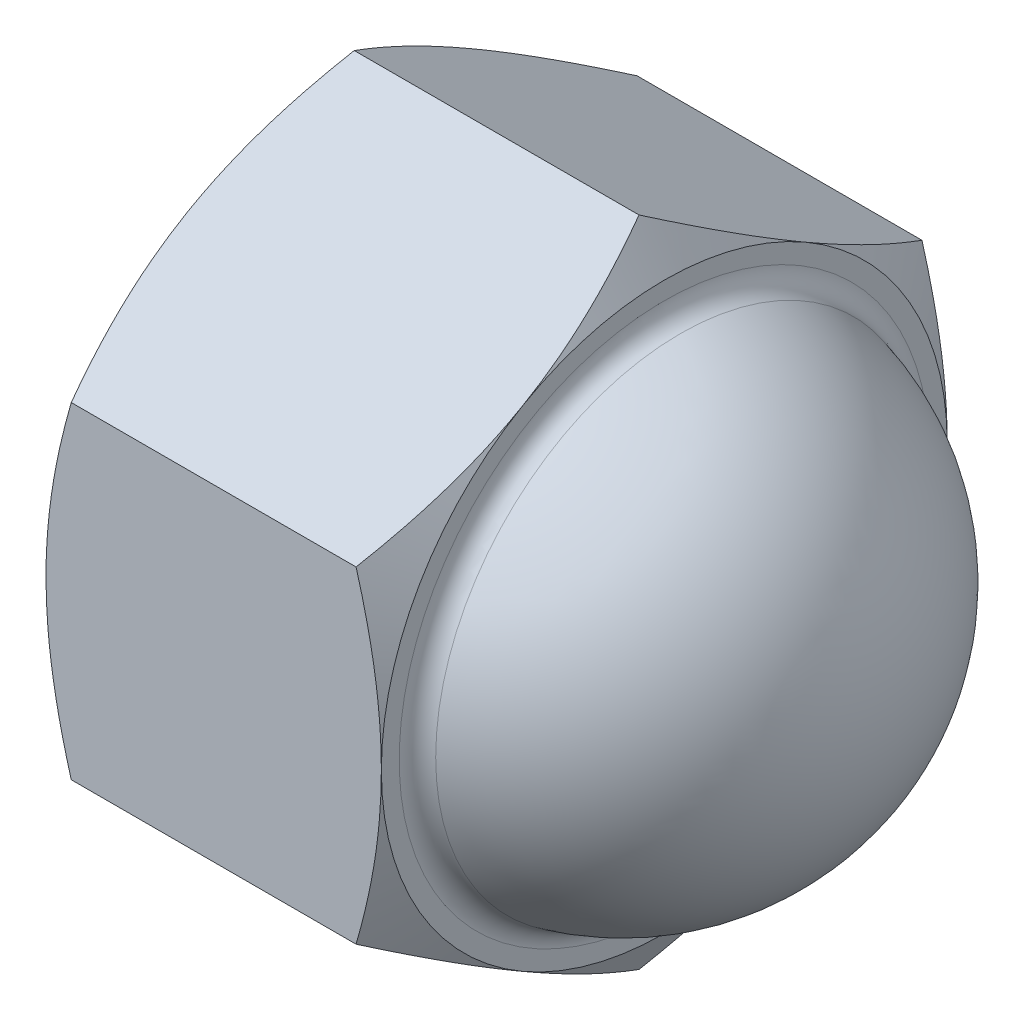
ISO-10303-21;
HEADER;
FILE_DESCRIPTION(('STEP AP214'),'2;1');
FILE_NAME('part.step','',(''),(''),'','','');
FILE_SCHEMA(('AUTOMOTIVE_DESIGN { 1 0 10303 214 1 1 1 1 }'));
ENDSEC;
DATA;
#1=APPLICATION_CONTEXT('core data for automotive mechanical design processes');
#2=APPLICATION_PROTOCOL_DEFINITION('international standard','automotive_design',2000,#1);
#3=PRODUCT_CONTEXT('',#1,'mechanical');
#4=PRODUCT('Part','Part','',(#3));
#5=PRODUCT_RELATED_PRODUCT_CATEGORY('part','',(#4));
#6=PRODUCT_DEFINITION_FORMATION('','',#4);
#7=PRODUCT_DEFINITION_CONTEXT('part definition',#1,'design');
#8=PRODUCT_DEFINITION('design','',#6,#7);
#9=PRODUCT_DEFINITION_SHAPE('','',#8);
#10=(LENGTH_UNIT() NAMED_UNIT(*) SI_UNIT(.MILLI.,.METRE.));
#11=(NAMED_UNIT(*) PLANE_ANGLE_UNIT() SI_UNIT($,.RADIAN.));
#12=(NAMED_UNIT(*) SI_UNIT($,.STERADIAN.) SOLID_ANGLE_UNIT());
#13=UNCERTAINTY_MEASURE_WITH_UNIT(LENGTH_MEASURE(1.E-05),#10,'distance_accuracy_value','');
#14=(GEOMETRIC_REPRESENTATION_CONTEXT(3) GLOBAL_UNCERTAINTY_ASSIGNED_CONTEXT((#13)) GLOBAL_UNIT_ASSIGNED_CONTEXT((#10,
#11,#12)) REPRESENTATION_CONTEXT('',''));
#15=CARTESIAN_POINT('',(0.,0.,0.));
#16=DIRECTION('',(0.,0.,1.));
#17=DIRECTION('',(1.,0.,0.));
#18=AXIS2_PLACEMENT_3D('',#15,#16,#17);
#19=CARTESIAN_POINT('',(16.,0.,27.));
#20=DIRECTION('',(1.,0.,0.));
#21=DIRECTION('',(0.,0.,-1.));
#22=AXIS2_PLACEMENT_3D('',#19,#20,#21);
#23=PLANE('',#22);
#24=CARTESIAN_POINT('',(16.,0.,0.));
#25=DIRECTION('',(1.,0.,0.));
#26=DIRECTION('',(0.,0.,-1.));
#27=AXIS2_PLACEMENT_3D('',#24,#25,#26);
#28=CIRCLE('',#27,12.6491106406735);
#29=CARTESIAN_POINT('',(16.,0.,-12.6491106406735));
#30=VERTEX_POINT('',#29);
#31=EDGE_CURVE('E42',#30,#30,#28,.F.);
#32=ORIENTED_EDGE('',*,*,#31,.T.);
#33=EDGE_LOOP('',(#32));
#34=FACE_BOUND('',#33,.T.);
#35=CARTESIAN_POINT('',(16.,0.,0.));
#36=DIRECTION('',(-1.,0.,0.));
#37=DIRECTION('',(0.,0.,1.));
#38=AXIS2_PLACEMENT_3D('',#35,#36,#37);
#39=CIRCLE('',#38,13.5);
#40=CARTESIAN_POINT('',(16.,0.,-13.5));
#41=VERTEX_POINT('',#40);
#42=CARTESIAN_POINT('',(16.,-11.69134295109,-6.75));
#43=VERTEX_POINT('',#42);
#44=EDGE_CURVE('E340',#41,#43,#39,.T.);
#45=ORIENTED_EDGE('',*,*,#44,.F.);
#46=CARTESIAN_POINT('',(16.,11.6913429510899,-6.75000000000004));
#47=VERTEX_POINT('',#46);
#48=EDGE_CURVE('E339',#47,#41,#39,.T.);
#49=ORIENTED_EDGE('',*,*,#48,.F.);
#50=CARTESIAN_POINT('',(16.,11.69134295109,6.75));
#51=VERTEX_POINT('',#50);
#52=EDGE_CURVE('E334',#51,#47,#39,.T.);
#53=ORIENTED_EDGE('',*,*,#52,.F.);
#54=CARTESIAN_POINT('',(16.,0.,13.5));
#55=VERTEX_POINT('',#54);
#56=EDGE_CURVE('E333',#55,#51,#39,.T.);
#57=ORIENTED_EDGE('',*,*,#56,.F.);
#58=CARTESIAN_POINT('',(16.,-11.6913429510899,6.75000000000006));
#59=VERTEX_POINT('',#58);
#60=EDGE_CURVE('E49',#59,#55,#39,.T.);
#61=ORIENTED_EDGE('',*,*,#60,.F.);
#62=EDGE_CURVE('E57',#43,#59,#39,.T.);
#63=ORIENTED_EDGE('',*,*,#62,.F.);
#64=EDGE_LOOP('',(#45,#49,#53,#57,#61,#63));
#65=FACE_BOUND('',#64,.T.);
#66=ADVANCED_FACE('F34',(#34,#65),#23,.T.);
#67=CARTESIAN_POINT('',(14.,0.,0.));
#68=DIRECTION('',(-1.,0.,0.));
#69=DIRECTION('',(0.,-1.,0.));
#70=AXIS2_PLACEMENT_3D('',#67,#68,#69);
#71=SPHERICAL_SURFACE('',#70,12.);
#72=CARTESIAN_POINT('',(16.7692307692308,0.,0.));
#73=DIRECTION('',(-1.,0.,0.));
#74=DIRECTION('',(0.,0.,1.));
#75=AXIS2_PLACEMENT_3D('',#72,#73,#74);
#76=CIRCLE('',#75,11.6761021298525);
#77=CARTESIAN_POINT('',(16.7692307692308,0.,11.6761021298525));
#78=VERTEX_POINT('',#77);
#79=EDGE_CURVE('E11',#78,#78,#76,.F.);
#80=ORIENTED_EDGE('',*,*,#79,.T.);
#81=EDGE_LOOP('',(#80));
#82=FACE_BOUND('',#81,.T.);
#83=ADVANCED_FACE('F282',(#82),#71,.T.);
#84=CARTESIAN_POINT('',(13.4951905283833,0.,0.));
#85=DIRECTION('',(-1.,0.,0.));
#86=DIRECTION('',(0.,0.,1.));
#87=AXIS2_PLACEMENT_3D('',#84,#85,#86);
#88=CONICAL_SURFACE('',#87,17.8384572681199,1.0471975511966);
#89=CARTESIAN_POINT('',(14.7941619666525,15.5885727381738,-0.000200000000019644));
#90=CARTESIAN_POINT('',(14.8930639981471,15.417258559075,0.296524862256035));
#91=CARTESIAN_POINT('',(14.9874780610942,15.2452761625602,0.594407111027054));
#92=CARTESIAN_POINT('',(15.1660827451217,14.899932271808,1.19256027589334));
#93=CARTESIAN_POINT('',(15.2502700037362,14.7265703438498,1.49283194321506));
#94=CARTESIAN_POINT('',(15.4072894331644,14.3781323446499,2.09634426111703));
#95=CARTESIAN_POINT('',(15.4800947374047,14.2030532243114,2.39959019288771));
#96=CARTESIAN_POINT('',(15.6127869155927,13.8516783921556,3.00818925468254));
#97=CARTESIAN_POINT('',(15.6726745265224,13.675382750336,3.31354226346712));
#98=CARTESIAN_POINT('',(15.7769840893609,13.3260922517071,3.91853115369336));
#99=CARTESIAN_POINT('',(15.8217512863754,13.1531233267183,4.21812211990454));
#100=CARTESIAN_POINT('',(15.8968160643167,12.8063928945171,4.8186768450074));
#101=CARTESIAN_POINT('',(15.927113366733,12.632631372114,5.11964063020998));
#102=CARTESIAN_POINT('',(15.9724733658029,12.284816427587,5.72207378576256));
#103=CARTESIAN_POINT('',(15.9875541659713,12.1107635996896,6.0235421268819));
#104=CARTESIAN_POINT('',(16.0021568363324,11.7624972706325,6.62675710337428));
#105=CARTESIAN_POINT('',(16.0016791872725,11.5882837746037,6.92850372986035));
#106=CARTESIAN_POINT('',(15.9862516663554,11.262592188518,7.49261810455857));
#107=CARTESIAN_POINT('',(15.973183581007,11.1110908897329,7.75502605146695));
#108=CARTESIAN_POINT('',(15.9355274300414,10.8084367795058,8.27923834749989));
#109=CARTESIAN_POINT('',(15.910938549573,10.6572839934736,8.54104265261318));
#110=CARTESIAN_POINT('',(15.850669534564,10.3554090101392,9.06390546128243));
#111=CARTESIAN_POINT('',(15.8149802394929,10.2046872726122,9.32496316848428));
#112=CARTESIAN_POINT('',(15.7331365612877,9.90395041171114,9.84585469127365));
#113=CARTESIAN_POINT('',(15.6869814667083,9.75393533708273,10.1056884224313));
#114=CARTESIAN_POINT('',(15.5316507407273,9.29855621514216,10.8944281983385));
#115=CARTESIAN_POINT('',(15.4069869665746,8.99451087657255,11.4210501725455));
#116=CARTESIAN_POINT('',(15.124051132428,8.39095390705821,12.4664415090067));
#117=CARTESIAN_POINT('',(14.9658455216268,8.09143454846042,12.9852242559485));
#118=CARTESIAN_POINT('',(14.7941619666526,7.79411316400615,13.5002));
#119=B_SPLINE_CURVE_WITH_KNOTS('',3,(#89,#90,#91,#92,#93,#94,#95,#96,#97,#98,#99,#100,#101,#102,
#103,#104,#105,#106,#107,#108,#109,#110,#111,#112,#113,#114,#115,#116,#117,#118),.UNSPECIFIED.,
.F.,.F.,(4,2,2,2,2,2,2,2,2,2,2,2,2,2,4),(0.,1.0698794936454,2.14010980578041,3.21282939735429,
4.28548777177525,5.33167033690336,6.37787303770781,7.42282956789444,8.46775380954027,
9.377387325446,10.2870851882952,11.1975357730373,12.1080482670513,13.9691139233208,
15.8265265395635),.UNSPECIFIED.);
#120=CARTESIAN_POINT('',(14.7942286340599,15.5884572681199,0.));
#121=VERTEX_POINT('',#120);
#122=EDGE_CURVE('E354',#121,#51,#119,.T.);
#123=ORIENTED_EDGE('',*,*,#122,.T.);
#124=ORIENTED_EDGE('',*,*,#52,.T.);
#125=CARTESIAN_POINT('',(14.7941619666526,7.79411316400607,-13.5002));
#126=CARTESIAN_POINT('',(14.8930639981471,7.96542734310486,-13.2034751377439));
#127=CARTESIAN_POINT('',(14.9874780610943,8.13740973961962,-12.9055928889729));
#128=CARTESIAN_POINT('',(15.1660827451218,8.4827536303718,-12.3074397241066));
#129=CARTESIAN_POINT('',(15.2502700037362,8.65611555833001,-12.0071680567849));
#130=CARTESIAN_POINT('',(15.4072894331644,9.00455355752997,-11.403655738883));
#131=CARTESIAN_POINT('',(15.4800947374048,9.17963267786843,-11.1004098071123));
#132=CARTESIAN_POINT('',(15.6127869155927,9.53100751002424,-10.4918107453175));
#133=CARTESIAN_POINT('',(15.6726745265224,9.70730315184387,-10.1864577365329));
#134=CARTESIAN_POINT('',(15.7769840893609,10.0565936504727,-9.58146884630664));
#135=CARTESIAN_POINT('',(15.8217512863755,10.2295625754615,-9.28187788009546));
#136=CARTESIAN_POINT('',(15.8968160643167,10.5762930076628,-8.6813231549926));
#137=CARTESIAN_POINT('',(15.927113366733,10.7500545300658,-8.38035936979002));
#138=CARTESIAN_POINT('',(15.9724733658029,11.0978694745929,-7.77792621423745));
#139=CARTESIAN_POINT('',(15.9875541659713,11.2719223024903,-7.47645787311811));
#140=CARTESIAN_POINT('',(16.0021568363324,11.6201886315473,-6.87324289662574));
#141=CARTESIAN_POINT('',(16.0016791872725,11.7944021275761,-6.57149627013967));
#142=CARTESIAN_POINT('',(15.9862516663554,12.1200937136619,-6.00738189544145));
#143=CARTESIAN_POINT('',(15.973183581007,12.2715950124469,-5.74497394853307));
#144=CARTESIAN_POINT('',(15.9355274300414,12.5742491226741,-5.22076165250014));
#145=CARTESIAN_POINT('',(15.910938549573,12.7254019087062,-4.95895734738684));
#146=CARTESIAN_POINT('',(15.850669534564,13.0272768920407,-4.43609453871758));
#147=CARTESIAN_POINT('',(15.8149802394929,13.1779986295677,-4.17503683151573));
#148=CARTESIAN_POINT('',(15.7331365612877,13.4787354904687,-3.65414530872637));
#149=CARTESIAN_POINT('',(15.6869814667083,13.6287505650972,-3.39431157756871));
#150=CARTESIAN_POINT('',(15.5316507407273,14.0841296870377,-2.60557180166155));
#151=CARTESIAN_POINT('',(15.4069869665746,14.3881750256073,-2.07894982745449));
#152=CARTESIAN_POINT('',(15.124051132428,14.9917319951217,-1.03355849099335));
#153=CARTESIAN_POINT('',(14.9658455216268,15.2912513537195,-0.514775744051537));
#154=CARTESIAN_POINT('',(14.7941619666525,15.5885727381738,0.000199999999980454));
#155=B_SPLINE_CURVE_WITH_KNOTS('',3,(#125,#126,#127,#128,#129,#130,#131,#132,#133,#134,#135,
#136,#137,#138,#139,#140,#141,#142,#143,#144,#145,#146,#147,#148,#149,#150,#151,#152,#153,#154),
.UNSPECIFIED.,.F.,.F.,(4,2,2,2,2,2,2,2,2,2,2,2,2,2,4),(0.,1.0698794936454,2.1401098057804,
3.21282939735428,4.28548777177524,5.33167033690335,6.3778730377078,7.42282956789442,
8.46775380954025,9.37738732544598,10.2870851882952,11.1975357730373,12.1080482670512,
13.9691139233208,15.8265265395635),.UNSPECIFIED.);
#156=EDGE_CURVE('E156',#47,#121,#155,.T.);
#157=ORIENTED_EDGE('',*,*,#156,.T.);
#158=EDGE_LOOP('',(#123,#124,#157));
#159=FACE_BOUND('',#158,.T.);
#160=ADVANCED_FACE('F286',(#159),#88,.T.);
#161=CARTESIAN_POINT('',(14.79422863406,7.79422863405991,-13.5));
#162=VERTEX_POINT('',#161);
#163=EDGE_CURVE('E266',#162,#47,#155,.T.);
#164=ORIENTED_EDGE('',*,*,#163,.T.);
#165=ORIENTED_EDGE('',*,*,#48,.T.);
#166=CARTESIAN_POINT('',(9.45241496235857,-20.8521667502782,-13.5));
#167=CARTESIAN_POINT('',(9.59511737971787,-20.557714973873,-13.5));
#168=CARTESIAN_POINT('',(9.73710179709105,-20.2629153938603,-13.5));
#169=CARTESIAN_POINT('',(10.0194718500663,-19.6725480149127,-13.5));
#170=CARTESIAN_POINT('',(10.1598574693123,-19.3769802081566,-13.5));
#171=CARTESIAN_POINT('',(10.5784094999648,-18.4889356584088,-13.5));
#172=CARTESIAN_POINT('',(10.8539281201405,-17.8952061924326,-13.5));
#173=CARTESIAN_POINT('',(11.3977239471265,-16.7004741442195,-13.5));
#174=CARTESIAN_POINT('',(11.6659528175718,-16.0994495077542,-13.5));
#175=CARTESIAN_POINT('',(12.1913253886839,-14.8925910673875,-13.5));
#176=CARTESIAN_POINT('',(12.4484696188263,-14.2867574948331,-13.5));
#177=CARTESIAN_POINT('',(12.9566456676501,-13.0500707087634,-13.5));
#178=CARTESIAN_POINT('',(13.2072277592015,-12.419031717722,-13.5));
#179=CARTESIAN_POINT('',(13.6892233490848,-11.149535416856,-13.5));
#180=CARTESIAN_POINT('',(13.9206346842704,-10.5110772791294,-13.5));
#181=CARTESIAN_POINT('',(14.3581485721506,-9.22697055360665,-13.5));
#182=CARTESIAN_POINT('',(14.5643030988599,-8.58133981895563,-13.5));
#183=CARTESIAN_POINT('',(14.944643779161,-7.28075613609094,-13.5));
#184=CARTESIAN_POINT('',(15.1188400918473,-6.62580622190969,-13.5));
#185=CARTESIAN_POINT('',(15.3493451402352,-5.63809606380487,-13.5));
#186=CARTESIAN_POINT('',(15.4208971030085,-5.308870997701,-13.5));
#187=CARTESIAN_POINT('',(15.5528778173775,-4.64818722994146,-13.5));
#188=CARTESIAN_POINT('',(15.6133068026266,-4.31672857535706,-13.5));
#189=CARTESIAN_POINT('',(15.7219699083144,-3.65181174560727,-13.5));
#190=CARTESIAN_POINT('',(15.7702041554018,-3.31835359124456,-13.5));
#191=CARTESIAN_POINT('',(15.8535123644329,-2.64979867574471,-13.5));
#192=CARTESIAN_POINT('',(15.8885868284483,-2.31470197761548,-13.5));
#193=CARTESIAN_POINT('',(15.9444436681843,-1.64767572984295,-13.5));
#194=CARTESIAN_POINT('',(15.9654049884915,-1.31576125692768,-13.5));
#195=CARTESIAN_POINT('',(15.9932782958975,-0.651344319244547,-13.5));
#196=CARTESIAN_POINT('',(16.0001905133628,-0.318841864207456,-13.5));
#197=CARTESIAN_POINT('',(15.999801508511,0.346158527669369,-13.5));
#198=CARTESIAN_POINT('',(15.9925001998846,0.678656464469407,-13.5));
#199=CARTESIAN_POINT('',(15.9638607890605,1.34305129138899,-13.5));
#200=CARTESIAN_POINT('',(15.9425220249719,1.67494815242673,-13.5));
#201=CARTESIAN_POINT('',(15.8745985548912,2.47518097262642,-13.5));
#202=CARTESIAN_POINT('',(15.8212102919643,2.94294940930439,-13.5));
#203=CARTESIAN_POINT('',(15.6894785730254,3.87496160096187,-13.5));
#204=CARTESIAN_POINT('',(15.6111316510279,4.33920485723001,-13.5));
#205=CARTESIAN_POINT('',(15.4322698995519,5.26374293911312,-13.5));
#206=CARTESIAN_POINT('',(15.3317374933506,5.72403433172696,-13.5));
#207=CARTESIAN_POINT('',(15.1115679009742,6.63997385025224,-13.5));
#208=CARTESIAN_POINT('',(14.9919310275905,7.09562205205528,-13.5));
#209=CARTESIAN_POINT('',(14.7336550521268,8.01220961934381,-13.5));
#210=CARTESIAN_POINT('',(14.5946582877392,8.47304750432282,-13.5));
#211=CARTESIAN_POINT('',(14.302490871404,9.3901827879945,-13.5));
#212=CARTESIAN_POINT('',(14.1493201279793,9.84648015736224,-13.5));
#213=CARTESIAN_POINT('',(13.8312202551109,10.7547628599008,-13.5));
#214=CARTESIAN_POINT('',(13.6662951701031,11.2067496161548,-13.5));
#215=CARTESIAN_POINT('',(13.3266084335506,12.1069908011,-13.5));
#216=CARTESIAN_POINT('',(13.1518468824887,12.5552452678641,-13.5));
#217=CARTESIAN_POINT('',(12.737707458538,13.5893059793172,-13.5));
#218=CARTESIAN_POINT('',(12.495332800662,14.1739100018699,-13.5));
#219=CARTESIAN_POINT('',(11.9993131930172,15.3383308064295,-13.5));
#220=CARTESIAN_POINT('',(11.7456676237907,15.9181473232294,-13.5));
#221=CARTESIAN_POINT('',(11.2292969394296,17.0738527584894,-13.5));
#222=CARTESIAN_POINT('',(10.9665700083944,17.6497408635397,-13.5));
#223=CARTESIAN_POINT('',(10.4338131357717,18.7981078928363,-13.5));
#224=CARTESIAN_POINT('',(10.1637833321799,19.3705868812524,-13.5));
#225=CARTESIAN_POINT('',(9.61747183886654,20.5132628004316,-13.5));
#226=CARTESIAN_POINT('',(9.34118408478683,21.0834568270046,-13.5));
#227=CARTESIAN_POINT('',(8.78366530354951,22.2214224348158,-13.5));
#228=CARTESIAN_POINT('',(8.50243425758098,22.7891940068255,-13.5));
#229=CARTESIAN_POINT('',(7.93588795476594,23.9226111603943,-13.5));
#230=CARTESIAN_POINT('',(7.65057317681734,24.4882569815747,-13.5));
#231=CARTESIAN_POINT('',(7.07647909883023,25.6177887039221,-13.5));
#232=CARTESIAN_POINT('',(6.78769978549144,26.1816745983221,-13.5));
#233=CARTESIAN_POINT('',(5.96367081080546,27.7804770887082,-13.5));
#234=CARTESIAN_POINT('',(5.42493945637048,28.8135992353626,-13.5));
#235=CARTESIAN_POINT('',(4.34004841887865,30.8759686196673,-13.5));
#236=CARTESIAN_POINT('',(3.79388849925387,31.9052157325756,-13.5));
#237=CARTESIAN_POINT('',(2.69713668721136,33.9582549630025,-13.5));
#238=CARTESIAN_POINT('',(2.14655812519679,34.9820542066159,-13.5));
#239=CARTESIAN_POINT('',(1.31735292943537,36.5159127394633,-13.5));
#240=CARTESIAN_POINT('',(1.04040202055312,37.0268792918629,-13.5));
#241=CARTESIAN_POINT('',(0.485497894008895,38.0482668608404,-13.5));
#242=CARTESIAN_POINT('',(0.207544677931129,38.5586878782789,-13.5));
#243=CARTESIAN_POINT('',(-0.0708527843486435,39.0688665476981,-13.5));
#244=B_SPLINE_CURVE_WITH_KNOTS('',3,(#166,#167,#168,#169,#170,#171,#172,#173,#174,#175,#176,
#177,#178,#179,#180,#181,#182,#183,#184,#185,#186,#187,#188,#189,#190,#191,#192,#193,#194,#195,
#196,#197,#198,#199,#200,#201,#202,#203,#204,#205,#206,#207,#208,#209,#210,#211,#212,#213,#214,
#215,#216,#217,#218,#219,#220,#221,#222,#223,#224,#225,#226,#227,#228,#229,#230,#231,#232,#233,
#234,#235,#236,#237,#238,#239,#240,#241,#242,#243),.UNSPECIFIED.,.F.,.F.,(4,2,2,2,2,2,2,2,2,2,2,
2,2,2,2,2,2,2,2,2,2,2,2,2,2,2,2,2,2,2,2,2,2,2,2,2,2,2,4),(0.,0.981625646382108,1.96326132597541,
3.92682754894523,5.90122666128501,7.87553135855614,9.91220651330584,11.9491111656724,
13.9817511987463,16.0137439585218,17.0243185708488,18.034871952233,19.0454148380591,
20.0559191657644,21.0533567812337,22.0507780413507,23.0482053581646,24.0456797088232,
25.4573125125,26.8691414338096,28.2820929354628,29.6950213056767,31.1387791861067,
32.5825463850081,34.0258191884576,35.4690772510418,37.367488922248,39.2660050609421,
41.1649030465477,43.0637651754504,44.964553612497,46.8653492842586,48.765923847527,
50.666505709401,54.1619080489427,57.6574219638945,61.1447718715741,62.8883586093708,
64.6319425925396),.UNSPECIFIED.);
#245=EDGE_CURVE('E347',#162,#41,#244,.F.);
#246=ORIENTED_EDGE('',*,*,#245,.F.);
#247=EDGE_LOOP('',(#164,#165,#246));
#248=FACE_BOUND('',#247,.T.);
#249=ADVANCED_FACE('F190',(#248),#88,.T.);
#250=CARTESIAN_POINT('',(14.7941619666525,-15.5885727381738,0.000200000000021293));
#251=CARTESIAN_POINT('',(14.8930639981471,-15.417258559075,-0.296524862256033));
#252=CARTESIAN_POINT('',(14.9874780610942,-15.2452761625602,-0.594407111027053));
#253=CARTESIAN_POINT('',(15.1660827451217,-14.899932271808,-1.19256027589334));
#254=CARTESIAN_POINT('',(15.2502700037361,-14.7265703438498,-1.49283194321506));
#255=CARTESIAN_POINT('',(15.4072894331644,-14.3781323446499,-2.09634426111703));
#256=CARTESIAN_POINT('',(15.4800947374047,-14.2030532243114,-2.39959019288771));
#257=CARTESIAN_POINT('',(15.6127869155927,-13.8516783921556,-3.00818925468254));
#258=CARTESIAN_POINT('',(15.6726745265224,-13.675382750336,-3.31354226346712));
#259=CARTESIAN_POINT('',(15.7769840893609,-13.3260922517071,-3.91853115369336));
#260=CARTESIAN_POINT('',(15.8217512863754,-13.1531233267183,-4.21812211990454));
#261=CARTESIAN_POINT('',(15.8968160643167,-12.8063928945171,-4.8186768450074));
#262=CARTESIAN_POINT('',(15.927113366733,-12.632631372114,-5.11964063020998));
#263=CARTESIAN_POINT('',(15.9724733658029,-12.284816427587,-5.72207378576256));
#264=CARTESIAN_POINT('',(15.9875541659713,-12.1107635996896,-6.0235421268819));
#265=CARTESIAN_POINT('',(16.0021568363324,-11.7624972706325,-6.62675710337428));
#266=CARTESIAN_POINT('',(16.0016791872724,-11.5882837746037,-6.92850372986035));
#267=CARTESIAN_POINT('',(15.9862516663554,-11.262592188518,-7.49261810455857));
#268=CARTESIAN_POINT('',(15.973183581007,-11.1110908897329,-7.75502605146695));
#269=CARTESIAN_POINT('',(15.9355274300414,-10.8084367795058,-8.27923834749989));
#270=CARTESIAN_POINT('',(15.910938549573,-10.6572839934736,-8.54104265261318));
#271=CARTESIAN_POINT('',(15.850669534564,-10.3554090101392,-9.06390546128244));
#272=CARTESIAN_POINT('',(15.8149802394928,-10.2046872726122,-9.32496316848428));
#273=CARTESIAN_POINT('',(15.7331365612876,-9.90395041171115,-9.84585469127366));
#274=CARTESIAN_POINT('',(15.6869814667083,-9.75393533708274,-10.1056884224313));
#275=CARTESIAN_POINT('',(15.5316507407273,-9.29855621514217,-10.8944281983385));
#276=CARTESIAN_POINT('',(15.4069869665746,-8.99451087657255,-11.4210501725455));
#277=CARTESIAN_POINT('',(15.124051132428,-8.39095390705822,-12.4664415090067));
#278=CARTESIAN_POINT('',(14.9658455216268,-8.09143454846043,-12.9852242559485));
#279=CARTESIAN_POINT('',(14.7941619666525,-7.79411316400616,-13.5002));
#280=B_SPLINE_CURVE_WITH_KNOTS('',3,(#250,#251,#252,#253,#254,#255,#256,#257,#258,#259,#260,
#261,#262,#263,#264,#265,#266,#267,#268,#269,#270,#271,#272,#273,#274,#275,#276,#277,#278,#279),
.UNSPECIFIED.,.F.,.F.,(4,2,2,2,2,2,2,2,2,2,2,2,2,2,4),(0.,1.0698794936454,2.14010980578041,
3.21282939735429,4.28548777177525,5.33167033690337,6.37787303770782,7.42282956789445,
8.46775380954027,9.377387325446,10.2870851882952,11.1975357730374,12.1080482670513,
13.9691139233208,15.8265265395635),.UNSPECIFIED.);
#281=CARTESIAN_POINT('',(14.7942286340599,-7.79422863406,-13.5));
#282=VERTEX_POINT('',#281);
#283=EDGE_CURVE('E233',#43,#282,#280,.T.);
#284=ORIENTED_EDGE('',*,*,#283,.T.);
#285=EDGE_CURVE('E363',#41,#282,#244,.F.);
#286=ORIENTED_EDGE('',*,*,#285,.F.);
#287=ORIENTED_EDGE('',*,*,#44,.T.);
#288=EDGE_LOOP('',(#284,#286,#287));
#289=FACE_BOUND('',#288,.T.);
#290=ADVANCED_FACE('F382',(#289),#88,.T.);
#291=CARTESIAN_POINT('',(14.7941619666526,-7.79411316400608,13.5002));
#292=CARTESIAN_POINT('',(14.8930639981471,-7.96542734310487,13.2034751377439));
#293=CARTESIAN_POINT('',(14.9874780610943,-8.13740973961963,12.9055928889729));
#294=CARTESIAN_POINT('',(15.1660827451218,-8.48275363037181,12.3074397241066));
#295=CARTESIAN_POINT('',(15.2502700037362,-8.65611555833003,12.0071680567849));
#296=CARTESIAN_POINT('',(15.4072894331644,-9.00455355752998,11.403655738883));
#297=CARTESIAN_POINT('',(15.4800947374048,-9.17963267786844,11.1004098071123));
#298=CARTESIAN_POINT('',(15.6127869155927,-9.53100751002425,10.4918107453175));
#299=CARTESIAN_POINT('',(15.6726745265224,-9.70730315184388,10.1864577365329));
#300=CARTESIAN_POINT('',(15.7769840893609,-10.0565936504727,9.58146884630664));
#301=CARTESIAN_POINT('',(15.8217512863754,-10.2295625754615,9.28187788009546));
#302=CARTESIAN_POINT('',(15.8968160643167,-10.5762930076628,8.68132315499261));
#303=CARTESIAN_POINT('',(15.927113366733,-10.7500545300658,8.38035936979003));
#304=CARTESIAN_POINT('',(15.9724733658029,-11.0978694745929,7.77792621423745));
#305=CARTESIAN_POINT('',(15.9875541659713,-11.2719223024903,7.47645787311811));
#306=CARTESIAN_POINT('',(16.0021568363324,-11.6201886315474,6.87324289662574));
#307=CARTESIAN_POINT('',(16.0016791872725,-11.7944021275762,6.57149627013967));
#308=CARTESIAN_POINT('',(15.9862516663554,-12.1200937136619,6.00738189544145));
#309=CARTESIAN_POINT('',(15.973183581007,-12.271595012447,5.74497394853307));
#310=CARTESIAN_POINT('',(15.9355274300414,-12.5742491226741,5.22076165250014));
#311=CARTESIAN_POINT('',(15.910938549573,-12.7254019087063,4.95895734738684));
#312=CARTESIAN_POINT('',(15.850669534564,-13.0272768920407,4.43609453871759));
#313=CARTESIAN_POINT('',(15.8149802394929,-13.1779986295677,4.17503683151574));
#314=CARTESIAN_POINT('',(15.7331365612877,-13.4787354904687,3.65414530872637));
#315=CARTESIAN_POINT('',(15.6869814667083,-13.6287505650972,3.39431157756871));
#316=CARTESIAN_POINT('',(15.5316507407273,-14.0841296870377,2.60557180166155));
#317=CARTESIAN_POINT('',(15.4069869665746,-14.3881750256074,2.07894982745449));
#318=CARTESIAN_POINT('',(15.124051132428,-14.9917319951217,1.03355849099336));
#319=CARTESIAN_POINT('',(14.9658455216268,-15.2912513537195,0.51477574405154));
#320=CARTESIAN_POINT('',(14.7941619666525,-15.5885727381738,-0.000199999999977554));
#321=B_SPLINE_CURVE_WITH_KNOTS('',3,(#291,#292,#293,#294,#295,#296,#297,#298,#299,#300,#301,
#302,#303,#304,#305,#306,#307,#308,#309,#310,#311,#312,#313,#314,#315,#316,#317,#318,#319,#320),
.UNSPECIFIED.,.F.,.F.,(4,2,2,2,2,2,2,2,2,2,2,2,2,2,4),(0.,1.0698794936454,2.1401098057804,
3.21282939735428,4.28548777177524,5.33167033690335,6.3778730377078,7.42282956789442,
8.46775380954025,9.37738732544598,10.2870851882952,11.1975357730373,12.1080482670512,
13.9691139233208,15.8265265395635),.UNSPECIFIED.);
#322=CARTESIAN_POINT('',(14.7942286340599,-15.5884572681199,0.));
#323=VERTEX_POINT('',#322);
#324=EDGE_CURVE('E225',#59,#323,#321,.T.);
#325=ORIENTED_EDGE('',*,*,#324,.T.);
#326=EDGE_CURVE('E232',#323,#43,#280,.T.);
#327=ORIENTED_EDGE('',*,*,#326,.T.);
#328=ORIENTED_EDGE('',*,*,#62,.T.);
#329=EDGE_LOOP('',(#325,#327,#328));
#330=FACE_BOUND('',#329,.T.);
#331=ADVANCED_FACE('F379',(#330),#88,.T.);
#332=CARTESIAN_POINT('',(9.45241496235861,-20.8521667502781,13.5));
#333=CARTESIAN_POINT('',(9.59511737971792,-20.5577149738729,13.5));
#334=CARTESIAN_POINT('',(9.73710179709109,-20.2629153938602,13.5));
#335=CARTESIAN_POINT('',(10.0194718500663,-19.6725480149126,13.5));
#336=CARTESIAN_POINT('',(10.1598574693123,-19.3769802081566,13.5));
#337=CARTESIAN_POINT('',(10.5784094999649,-18.4889356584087,13.5));
#338=CARTESIAN_POINT('',(10.8539281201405,-17.8952061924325,13.5));
#339=CARTESIAN_POINT('',(11.3977239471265,-16.7004741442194,13.5));
#340=CARTESIAN_POINT('',(11.6659528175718,-16.0994495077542,13.5));
#341=CARTESIAN_POINT('',(12.191325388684,-14.8925910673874,13.5));
#342=CARTESIAN_POINT('',(12.4484696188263,-14.286757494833,13.5));
#343=CARTESIAN_POINT('',(12.9566456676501,-13.0500707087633,13.5));
#344=CARTESIAN_POINT('',(13.2072277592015,-12.4190317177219,13.5));
#345=CARTESIAN_POINT('',(13.6892233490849,-11.1495354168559,13.5));
#346=CARTESIAN_POINT('',(13.9206346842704,-10.5110772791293,13.5));
#347=CARTESIAN_POINT('',(14.3581485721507,-9.22697055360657,13.5));
#348=CARTESIAN_POINT('',(14.56430309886,-8.58133981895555,13.5));
#349=CARTESIAN_POINT('',(14.944643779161,-7.28075613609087,13.5));
#350=CARTESIAN_POINT('',(15.1188400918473,-6.62580622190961,13.5));
#351=CARTESIAN_POINT('',(15.3493451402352,-5.63809606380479,13.5));
#352=CARTESIAN_POINT('',(15.4208971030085,-5.30887099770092,13.5));
#353=CARTESIAN_POINT('',(15.5528778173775,-4.64818722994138,13.5));
#354=CARTESIAN_POINT('',(15.6133068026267,-4.31672857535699,13.5));
#355=CARTESIAN_POINT('',(15.7219699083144,-3.6518117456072,13.5));
#356=CARTESIAN_POINT('',(15.7702041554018,-3.31835359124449,13.5));
#357=CARTESIAN_POINT('',(15.8535123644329,-2.64979867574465,13.5));
#358=CARTESIAN_POINT('',(15.8885868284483,-2.31470197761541,13.5));
#359=CARTESIAN_POINT('',(15.9444436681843,-1.64767572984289,13.5));
#360=CARTESIAN_POINT('',(15.9654049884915,-1.31576125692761,13.5));
#361=CARTESIAN_POINT('',(15.9932782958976,-0.65134431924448,13.5));
#362=CARTESIAN_POINT('',(16.0001905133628,-0.31884186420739,13.5));
#363=CARTESIAN_POINT('',(15.999801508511,0.346158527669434,13.5));
#364=CARTESIAN_POINT('',(15.9925001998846,0.678656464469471,13.5));
#365=CARTESIAN_POINT('',(15.9638607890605,1.34305129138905,13.5));
#366=CARTESIAN_POINT('',(15.9425220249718,1.6749481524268,13.5));
#367=CARTESIAN_POINT('',(15.8745985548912,2.47518097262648,13.5));
#368=CARTESIAN_POINT('',(15.8212102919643,2.94294940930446,13.5));
#369=CARTESIAN_POINT('',(15.6894785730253,3.87496160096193,13.5));
#370=CARTESIAN_POINT('',(15.6111316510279,4.33920485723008,13.5));
#371=CARTESIAN_POINT('',(15.4322698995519,5.26374293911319,13.5));
#372=CARTESIAN_POINT('',(15.3317374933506,5.72403433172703,13.5));
#373=CARTESIAN_POINT('',(15.1115679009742,6.63997385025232,13.5));
#374=CARTESIAN_POINT('',(14.9919310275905,7.09562205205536,13.5));
#375=CARTESIAN_POINT('',(14.7336550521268,8.0122096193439,13.5));
#376=CARTESIAN_POINT('',(14.5946582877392,8.4730475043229,13.5));
#377=CARTESIAN_POINT('',(14.302490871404,9.39018278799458,13.5));
#378=CARTESIAN_POINT('',(14.1493201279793,9.84648015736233,13.5));
#379=CARTESIAN_POINT('',(13.8312202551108,10.7547628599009,13.5));
#380=CARTESIAN_POINT('',(13.6662951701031,11.2067496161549,13.5));
#381=CARTESIAN_POINT('',(13.3266084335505,12.1069908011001,13.5));
#382=CARTESIAN_POINT('',(13.1518468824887,12.5552452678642,13.5));
#383=CARTESIAN_POINT('',(12.7377074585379,13.5893059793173,13.5));
#384=CARTESIAN_POINT('',(12.495332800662,14.17391000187,13.5));
#385=CARTESIAN_POINT('',(11.9993131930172,15.3383308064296,13.5));
#386=CARTESIAN_POINT('',(11.7456676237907,15.9181473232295,13.5));
#387=CARTESIAN_POINT('',(11.2292969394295,17.0738527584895,13.5));
#388=CARTESIAN_POINT('',(10.9665700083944,17.6497408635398,13.5));
#389=CARTESIAN_POINT('',(10.4338131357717,18.7981078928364,13.5));
#390=CARTESIAN_POINT('',(10.1637833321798,19.3705868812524,13.5));
#391=CARTESIAN_POINT('',(9.61747183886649,20.5132628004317,13.5));
#392=CARTESIAN_POINT('',(9.34118408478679,21.0834568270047,13.5));
#393=CARTESIAN_POINT('',(8.78366530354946,22.2214224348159,13.5));
#394=CARTESIAN_POINT('',(8.50243425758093,22.7891940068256,13.5));
#395=CARTESIAN_POINT('',(7.9358879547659,23.9226111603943,13.5));
#396=CARTESIAN_POINT('',(7.6505731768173,24.4882569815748,13.5));
#397=CARTESIAN_POINT('',(7.07647909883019,25.6177887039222,13.5));
#398=CARTESIAN_POINT('',(6.78769978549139,26.1816745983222,13.5));
#399=CARTESIAN_POINT('',(5.96367081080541,27.7804770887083,13.5));
#400=CARTESIAN_POINT('',(5.42493945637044,28.8135992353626,13.5));
#401=CARTESIAN_POINT('',(4.34004841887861,30.8759686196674,13.5));
#402=CARTESIAN_POINT('',(3.79388849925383,31.9052157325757,13.5));
#403=CARTESIAN_POINT('',(2.69713668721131,33.9582549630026,13.5));
#404=CARTESIAN_POINT('',(2.14655812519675,34.982054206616,13.5));
#405=CARTESIAN_POINT('',(1.31735292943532,36.5159127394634,13.5));
#406=CARTESIAN_POINT('',(1.04040202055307,37.026879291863,13.5));
#407=CARTESIAN_POINT('',(0.485497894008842,38.0482668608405,13.5));
#408=CARTESIAN_POINT('',(0.207544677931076,38.558687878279,13.5));
#409=CARTESIAN_POINT('',(-0.0708527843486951,39.0688665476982,13.5));
#410=B_SPLINE_CURVE_WITH_KNOTS('',3,(#332,#333,#334,#335,#336,#337,#338,#339,#340,#341,#342,
#343,#344,#345,#346,#347,#348,#349,#350,#351,#352,#353,#354,#355,#356,#357,#358,#359,#360,#361,
#362,#363,#364,#365,#366,#367,#368,#369,#370,#371,#372,#373,#374,#375,#376,#377,#378,#379,#380,
#381,#382,#383,#384,#385,#386,#387,#388,#389,#390,#391,#392,#393,#394,#395,#396,#397,#398,#399,
#400,#401,#402,#403,#404,#405,#406,#407,#408,#409),.UNSPECIFIED.,.F.,.F.,(4,2,2,2,2,2,2,2,2,2,2,
2,2,2,2,2,2,2,2,2,2,2,2,2,2,2,2,2,2,2,2,2,2,2,2,2,2,2,4),(0.,0.981625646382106,1.96326132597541,
3.92682754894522,5.901226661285,7.87553135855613,9.91220651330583,11.9491111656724,
13.9817511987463,16.0137439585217,17.0243185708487,18.034871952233,19.045414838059,
20.0559191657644,21.0533567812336,22.0507780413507,23.0482053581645,24.0456797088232,
25.4573125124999,26.8691414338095,28.2820929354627,29.6950213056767,31.1387791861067,
32.5825463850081,34.0258191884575,35.4690772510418,37.367488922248,39.2660050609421,
41.1649030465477,43.0637651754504,44.964553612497,46.8653492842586,48.765923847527,
50.666505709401,54.1619080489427,57.6574219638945,61.1447718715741,62.8883586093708,
64.6319425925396),.UNSPECIFIED.);
#411=CARTESIAN_POINT('',(14.79422863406,-7.79422863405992,13.5));
#412=VERTEX_POINT('',#411);
#413=EDGE_CURVE('E238',#55,#412,#410,.F.);
#414=ORIENTED_EDGE('',*,*,#413,.T.);
#415=EDGE_CURVE('E231',#412,#59,#321,.T.);
#416=ORIENTED_EDGE('',*,*,#415,.T.);
#417=ORIENTED_EDGE('',*,*,#60,.T.);
#418=EDGE_LOOP('',(#414,#416,#417));
#419=FACE_BOUND('',#418,.T.);
#420=ADVANCED_FACE('F373',(#419),#88,.T.);
#421=CARTESIAN_POINT('',(14.79422863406,7.79422863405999,13.5));
#422=VERTEX_POINT('',#421);
#423=EDGE_CURVE('E260',#51,#422,#119,.T.);
#424=ORIENTED_EDGE('',*,*,#423,.T.);
#425=EDGE_CURVE('E243',#422,#55,#410,.F.);
#426=ORIENTED_EDGE('',*,*,#425,.T.);
#427=ORIENTED_EDGE('',*,*,#56,.T.);
#428=EDGE_LOOP('',(#424,#426,#427));
#429=FACE_BOUND('',#428,.T.);
#430=ADVANCED_FACE('F273',(#429),#88,.T.);
#431=CARTESIAN_POINT('',(16.,7.79422863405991,-13.5));
#432=DIRECTION('',(0.,-0.866025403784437,0.500000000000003));
#433=DIRECTION('',(0.,-0.500000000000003,-0.866025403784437));
#434=AXIS2_PLACEMENT_3D('',#431,#432,#433);
#435=PLANE('',#434);
#436=ORIENTED_EDGE('',*,*,#163,.F.);
#437=DIRECTION('',(-1.,0.,0.));
#438=VECTOR('',#437,1.);
#439=CARTESIAN_POINT('',(16.,7.79422863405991,-13.5));
#440=LINE('',#439,#438);
#441=CARTESIAN_POINT('',(1.20577136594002,7.79422863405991,-13.5));
#442=VERTEX_POINT('',#441);
#443=EDGE_CURVE('E247',#162,#442,#440,.T.);
#444=ORIENTED_EDGE('',*,*,#443,.T.);
#445=CARTESIAN_POINT('',(1.20583803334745,15.5885727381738,0.000199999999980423));
#446=CARTESIAN_POINT('',(1.10693600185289,15.417258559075,-0.296524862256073));
#447=CARTESIAN_POINT('',(1.01252193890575,15.2452761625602,-0.594407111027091));
#448=CARTESIAN_POINT('',(0.833917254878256,14.899932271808,-1.19256027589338));
#449=CARTESIAN_POINT('',(0.749729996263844,14.7265703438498,-1.4928319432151));
#450=CARTESIAN_POINT('',(0.592710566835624,14.3781323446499,-2.09634426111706));
#451=CARTESIAN_POINT('',(0.519905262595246,14.2030532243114,-2.39959019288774));
#452=CARTESIAN_POINT('',(0.387213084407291,13.8516783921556,-3.00818925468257));
#453=CARTESIAN_POINT('',(0.327325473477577,13.675382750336,-3.31354226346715));
#454=CARTESIAN_POINT('',(0.223015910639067,13.3260922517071,-3.91853115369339));
#455=CARTESIAN_POINT('',(0.178248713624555,13.1531233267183,-4.21812211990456));
#456=CARTESIAN_POINT('',(0.103183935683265,12.8063928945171,-4.81867684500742));
#457=CARTESIAN_POINT('',(0.0728866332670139,12.632631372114,-5.11964063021));
#458=CARTESIAN_POINT('',(0.0275266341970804,12.284816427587,-5.72207378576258));
#459=CARTESIAN_POINT('',(0.0124458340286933,12.1107635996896,-6.02354212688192));
#460=CARTESIAN_POINT('',(-0.0021568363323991,11.7624972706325,-6.62675710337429));
#461=CARTESIAN_POINT('',(-0.00167918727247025,11.5882837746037,-6.92850372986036));
#462=CARTESIAN_POINT('',(0.0137483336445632,11.2625921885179,-7.49261810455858));
#463=CARTESIAN_POINT('',(0.0268164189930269,11.1110908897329,-7.75502605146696));
#464=CARTESIAN_POINT('',(0.0644725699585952,10.8084367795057,-8.27923834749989));
#465=CARTESIAN_POINT('',(0.0890614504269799,10.6572839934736,-8.54104265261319));
#466=CARTESIAN_POINT('',(0.149330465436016,10.3554090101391,-9.06390546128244));
#467=CARTESIAN_POINT('',(0.185019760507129,10.2046872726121,-9.32496316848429));
#468=CARTESIAN_POINT('',(0.266863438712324,9.90395041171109,-9.84585469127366));
#469=CARTESIAN_POINT('',(0.31301853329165,9.75393533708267,-10.1056884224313));
#470=CARTESIAN_POINT('',(0.468349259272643,9.2985562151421,-10.8944281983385));
#471=CARTESIAN_POINT('',(0.593013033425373,8.99451087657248,-11.4210501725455));
#472=CARTESIAN_POINT('',(0.875948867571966,8.39095390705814,-12.4664415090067));
#473=CARTESIAN_POINT('',(1.03415447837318,8.09143454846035,-12.9852242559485));
#474=CARTESIAN_POINT('',(1.20583803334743,7.79411316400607,-13.5002));
#475=B_SPLINE_CURVE_WITH_KNOTS('',3,(#445,#446,#447,#448,#449,#450,#451,#452,#453,#454,#455,
#456,#457,#458,#459,#460,#461,#462,#463,#464,#465,#466,#467,#468,#469,#470,#471,#472,#473,#474),
.UNSPECIFIED.,.F.,.F.,(4,2,2,2,2,2,2,2,2,2,2,2,2,2,4),(0.,1.0698794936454,2.14010980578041,
3.21282939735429,4.28548777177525,5.33167033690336,6.37787303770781,7.42282956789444,
8.46775380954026,9.37738732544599,10.2870851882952,11.1975357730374,12.1080482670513,
13.9691139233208,15.8265265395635),.UNSPECIFIED.);
#476=CARTESIAN_POINT('',(0.,11.6913429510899,-6.75000000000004));
#477=VERTEX_POINT('',#476);
#478=EDGE_CURVE('E131',#477,#442,#475,.T.);
#479=ORIENTED_EDGE('',*,*,#478,.F.);
#480=CARTESIAN_POINT('',(1.20577136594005,15.5884572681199,0.));
#481=VERTEX_POINT('',#480);
#482=EDGE_CURVE('E137',#481,#477,#475,.T.);
#483=ORIENTED_EDGE('',*,*,#482,.F.);
#484=DIRECTION('',(-1.,0.,0.));
#485=VECTOR('',#484,1.);
#486=CARTESIAN_POINT('',(16.,15.5884572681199,0.));
#487=LINE('',#486,#485);
#488=EDGE_CURVE('E244',#121,#481,#487,.T.);
#489=ORIENTED_EDGE('',*,*,#488,.F.);
#490=ORIENTED_EDGE('',*,*,#156,.F.);
#491=EDGE_LOOP('',(#436,#444,#479,#483,#489,#490));
#492=FACE_BOUND('',#491,.T.);
#493=ADVANCED_FACE('F269',(#492),#435,.F.);
#494=CARTESIAN_POINT('',(16.,7.79422863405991,-13.5));
#495=DIRECTION('',(0.,0.,-1.));
#496=DIRECTION('',(-1.,0.,0.));
#497=AXIS2_PLACEMENT_3D('',#494,#495,#496);
#498=PLANE('',#497);
#499=ORIENTED_EDGE('',*,*,#443,.F.);
#500=ORIENTED_EDGE('',*,*,#245,.T.);
#501=ORIENTED_EDGE('',*,*,#285,.T.);
#502=DIRECTION('',(-1.,0.,0.));
#503=VECTOR('',#502,1.);
#504=CARTESIAN_POINT('',(16.,-7.79422863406,-13.5));
#505=LINE('',#504,#503);
#506=CARTESIAN_POINT('',(1.20577136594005,-7.79422863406,-13.5));
#507=VERTEX_POINT('',#506);
#508=EDGE_CURVE('E161',#282,#507,#505,.T.);
#509=ORIENTED_EDGE('',*,*,#508,.T.);
#510=CARTESIAN_POINT('',(6.54758503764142,-20.8521667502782,-13.5));
#511=CARTESIAN_POINT('',(6.40488262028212,-20.557714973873,-13.5));
#512=CARTESIAN_POINT('',(6.26289820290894,-20.2629153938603,-13.5));
#513=CARTESIAN_POINT('',(5.98052814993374,-19.6725480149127,-13.5));
#514=CARTESIAN_POINT('',(5.84014253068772,-19.3769802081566,-13.5));
#515=CARTESIAN_POINT('',(5.42159050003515,-18.4889356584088,-13.5));
#516=CARTESIAN_POINT('',(5.14607187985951,-17.8952061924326,-13.5));
#517=CARTESIAN_POINT('',(4.60227605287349,-16.7004741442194,-13.5));
#518=CARTESIAN_POINT('',(4.33404718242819,-16.0994495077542,-13.5));
#519=CARTESIAN_POINT('',(3.80867461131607,-14.8925910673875,-13.5));
#520=CARTESIAN_POINT('',(3.5515303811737,-14.2867574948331,-13.5));
#521=CARTESIAN_POINT('',(3.04335433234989,-13.0500707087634,-13.5));
#522=CARTESIAN_POINT('',(2.79277224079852,-12.4190317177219,-13.5));
#523=CARTESIAN_POINT('',(2.31077665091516,-11.149535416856,-13.5));
#524=CARTESIAN_POINT('',(2.07936531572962,-10.5110772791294,-13.5));
#525=CARTESIAN_POINT('',(1.64185142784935,-9.22697055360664,-13.5));
#526=CARTESIAN_POINT('',(1.43569690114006,-8.58133981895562,-13.5));
#527=CARTESIAN_POINT('',(1.05535622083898,-7.28075613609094,-13.5));
#528=CARTESIAN_POINT('',(0.88115990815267,-6.62580622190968,-13.5));
#529=CARTESIAN_POINT('',(0.650654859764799,-5.63809606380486,-13.5));
#530=CARTESIAN_POINT('',(0.579102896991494,-5.308870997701,-13.5));
#531=CARTESIAN_POINT('',(0.447122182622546,-4.64818722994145,-13.5));
#532=CARTESIAN_POINT('',(0.386693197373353,-4.31672857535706,-13.5));
#533=CARTESIAN_POINT('',(0.278030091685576,-3.65181174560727,-13.5));
#534=CARTESIAN_POINT('',(0.229795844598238,-3.31835359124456,-13.5));
#535=CARTESIAN_POINT('',(0.14648763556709,-2.64979867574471,-13.5));
#536=CARTESIAN_POINT('',(0.111413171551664,-2.31470197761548,-13.5));
#537=CARTESIAN_POINT('',(0.0555563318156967,-1.64767572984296,-13.5));
#538=CARTESIAN_POINT('',(0.0345950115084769,-1.31576125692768,-13.5));
#539=CARTESIAN_POINT('',(0.00672170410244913,-0.651344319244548,-13.5));
#540=CARTESIAN_POINT('',(-0.000190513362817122,-0.318841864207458,-13.5));
#541=CARTESIAN_POINT('',(0.000198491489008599,0.346158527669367,-13.5));
#542=CARTESIAN_POINT('',(0.00749980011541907,0.678656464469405,-13.5));
#543=CARTESIAN_POINT('',(0.0361392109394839,1.34305129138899,-13.5));
#544=CARTESIAN_POINT('',(0.0574779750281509,1.67494815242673,-13.5));
#545=CARTESIAN_POINT('',(0.125401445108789,2.47518097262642,-13.5));
#546=CARTESIAN_POINT('',(0.178789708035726,2.94294940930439,-13.5));
#547=CARTESIAN_POINT('',(0.310521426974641,3.87496160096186,-13.5));
#548=CARTESIAN_POINT('',(0.388868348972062,4.33920485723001,-13.5));
#549=CARTESIAN_POINT('',(0.567730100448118,5.26374293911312,-13.5));
#550=CARTESIAN_POINT('',(0.668262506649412,5.72403433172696,-13.5));
#551=CARTESIAN_POINT('',(0.888432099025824,6.63997385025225,-13.5));
#552=CARTESIAN_POINT('',(1.00806897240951,7.09562205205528,-13.5));
#553=CARTESIAN_POINT('',(1.26634494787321,8.01220961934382,-13.5));
#554=CARTESIAN_POINT('',(1.40534171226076,8.47304750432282,-13.5));
#555=CARTESIAN_POINT('',(1.69750912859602,9.3901827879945,-13.5));
#556=CARTESIAN_POINT('',(1.85067987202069,9.84648015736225,-13.5));
#557=CARTESIAN_POINT('',(2.16877974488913,10.7547628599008,-13.5));
#558=CARTESIAN_POINT('',(2.33370482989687,11.2067496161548,-13.5));
#559=CARTESIAN_POINT('',(2.67339156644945,12.1069908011,-13.5));
#560=CARTESIAN_POINT('',(2.84815311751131,12.5552452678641,-13.5));
#561=CARTESIAN_POINT('',(3.26229254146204,13.5893059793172,-13.5));
#562=CARTESIAN_POINT('',(3.50466719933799,14.17391000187,-13.5));
#563=CARTESIAN_POINT('',(4.00068680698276,15.3383308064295,-13.5));
#564=CARTESIAN_POINT('',(4.25433237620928,15.9181473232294,-13.5));
#565=CARTESIAN_POINT('',(4.77070306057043,17.0738527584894,-13.5));
#566=CARTESIAN_POINT('',(5.03342999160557,17.6497408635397,-13.5));
#567=CARTESIAN_POINT('',(5.56618686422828,18.7981078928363,-13.5));
#568=CARTESIAN_POINT('',(5.83621666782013,19.3705868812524,-13.5));
#569=CARTESIAN_POINT('',(6.38252816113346,20.5132628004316,-13.5));
#570=CARTESIAN_POINT('',(6.65881591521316,21.0834568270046,-13.5));
#571=CARTESIAN_POINT('',(7.21633469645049,22.2214224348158,-13.5));
#572=CARTESIAN_POINT('',(7.49756574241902,22.7891940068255,-13.5));
#573=CARTESIAN_POINT('',(8.06411204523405,23.9226111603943,-13.5));
#574=CARTESIAN_POINT('',(8.34942682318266,24.4882569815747,-13.5));
#575=CARTESIAN_POINT('',(8.92352090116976,25.6177887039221,-13.5));
#576=CARTESIAN_POINT('',(9.21230021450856,26.1816745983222,-13.5));
#577=CARTESIAN_POINT('',(10.0363291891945,27.7804770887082,-13.5));
#578=CARTESIAN_POINT('',(10.5750605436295,28.8135992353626,-13.5));
#579=CARTESIAN_POINT('',(11.6599515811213,30.8759686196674,-13.5));
#580=CARTESIAN_POINT('',(12.2061115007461,31.9052157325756,-13.5));
#581=CARTESIAN_POINT('',(13.3028633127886,33.9582549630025,-13.5));
#582=CARTESIAN_POINT('',(13.8534418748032,34.9820542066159,-13.5));
#583=CARTESIAN_POINT('',(14.6826470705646,36.5159127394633,-13.5));
#584=CARTESIAN_POINT('',(14.9595979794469,37.0268792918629,-13.5));
#585=CARTESIAN_POINT('',(15.5145021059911,38.0482668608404,-13.5));
#586=CARTESIAN_POINT('',(15.7924553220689,38.5586878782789,-13.5));
#587=CARTESIAN_POINT('',(16.0708527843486,39.0688665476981,-13.5));
#588=B_SPLINE_CURVE_WITH_KNOTS('',3,(#510,#511,#512,#513,#514,#515,#516,#517,#518,#519,#520,
#521,#522,#523,#524,#525,#526,#527,#528,#529,#530,#531,#532,#533,#534,#535,#536,#537,#538,#539,
#540,#541,#542,#543,#544,#545,#546,#547,#548,#549,#550,#551,#552,#553,#554,#555,#556,#557,#558,
#559,#560,#561,#562,#563,#564,#565,#566,#567,#568,#569,#570,#571,#572,#573,#574,#575,#576,#577,
#578,#579,#580,#581,#582,#583,#584,#585,#586,#587),.UNSPECIFIED.,.F.,.F.,(4,2,2,2,2,2,2,2,2,2,2,
2,2,2,2,2,2,2,2,2,2,2,2,2,2,2,2,2,2,2,2,2,2,2,2,2,2,2,4),(0.,0.981625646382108,1.96326132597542,
3.92682754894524,5.90122666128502,7.87553135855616,9.91220651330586,11.9491111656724,
13.9817511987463,16.0137439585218,17.0243185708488,18.034871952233,19.0454148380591,
20.0559191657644,21.0533567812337,22.0507780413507,23.0482053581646,24.0456797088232,
25.4573125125,26.8691414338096,28.2820929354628,29.6950213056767,31.1387791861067,
32.5825463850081,34.0258191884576,35.4690772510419,37.367488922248,39.2660050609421,
41.1649030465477,43.0637651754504,44.964553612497,46.8653492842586,48.765923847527,
50.6665057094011,54.1619080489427,57.6574219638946,61.1447718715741,62.8883586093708,
64.6319425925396),.UNSPECIFIED.);
#589=CARTESIAN_POINT('',(0.,0.,-13.5));
#590=VERTEX_POINT('',#589);
#591=EDGE_CURVE('E136',#507,#590,#588,.T.);
#592=ORIENTED_EDGE('',*,*,#591,.T.);
#593=EDGE_CURVE('E124',#590,#442,#588,.T.);
#594=ORIENTED_EDGE('',*,*,#593,.T.);
#595=EDGE_LOOP('',(#499,#500,#501,#509,#592,#594));
#596=FACE_BOUND('',#595,.T.);
#597=ADVANCED_FACE('F158',(#596),#498,.T.);
#598=CARTESIAN_POINT('',(16.,-15.5884572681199,0.));
#599=DIRECTION('',(0.,0.866025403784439,0.499999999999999));
#600=DIRECTION('',(0.,-0.499999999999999,0.866025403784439));
#601=AXIS2_PLACEMENT_3D('',#598,#599,#600);
#602=PLANE('',#601);
#603=ORIENTED_EDGE('',*,*,#326,.F.);
#604=DIRECTION('',(-1.,0.,0.));
#605=VECTOR('',#604,1.);
#606=CARTESIAN_POINT('',(16.,-15.5884572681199,0.));
#607=LINE('',#606,#605);
#608=CARTESIAN_POINT('',(1.20577136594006,-15.5884572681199,0.));
#609=VERTEX_POINT('',#608);
#610=EDGE_CURVE('E251',#323,#609,#607,.T.);
#611=ORIENTED_EDGE('',*,*,#610,.T.);
#612=CARTESIAN_POINT('',(1.20583803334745,-7.79411316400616,-13.5002));
#613=CARTESIAN_POINT('',(1.10693600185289,-7.96542734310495,-13.2034751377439));
#614=CARTESIAN_POINT('',(1.01252193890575,-8.1374097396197,-12.9055928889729));
#615=CARTESIAN_POINT('',(0.83391725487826,-8.48275363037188,-12.3074397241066));
#616=CARTESIAN_POINT('',(0.749729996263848,-8.65611555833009,-12.0071680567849));
#617=CARTESIAN_POINT('',(0.59271056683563,-9.00455355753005,-11.4036557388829));
#618=CARTESIAN_POINT('',(0.519905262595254,-9.17963267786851,-11.1004098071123));
#619=CARTESIAN_POINT('',(0.387213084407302,-9.53100751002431,-10.4918107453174));
#620=CARTESIAN_POINT('',(0.327325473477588,-9.70730315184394,-10.1864577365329));
#621=CARTESIAN_POINT('',(0.223015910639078,-10.0565936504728,-9.58146884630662));
#622=CARTESIAN_POINT('',(0.178248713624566,-10.2295625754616,-9.28187788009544));
#623=CARTESIAN_POINT('',(0.10318393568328,-10.5762930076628,-8.68132315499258));
#624=CARTESIAN_POINT('',(0.0728866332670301,-10.7500545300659,-8.38035936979));
#625=CARTESIAN_POINT('',(0.0275266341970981,-11.0978694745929,-7.77792621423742));
#626=CARTESIAN_POINT('',(0.0124458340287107,-11.2719223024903,-7.47645787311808));
#627=CARTESIAN_POINT('',(-0.00215683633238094,-11.6201886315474,-6.8732428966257));
#628=CARTESIAN_POINT('',(-0.00167918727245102,-11.7944021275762,-6.57149627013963));
#629=CARTESIAN_POINT('',(0.0137483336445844,-12.1200937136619,-6.00738189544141));
#630=CARTESIAN_POINT('',(0.026816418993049,-12.271595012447,-5.74497394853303));
#631=CARTESIAN_POINT('',(0.0644725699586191,-12.5742491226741,-5.2207616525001));
#632=CARTESIAN_POINT('',(0.0890614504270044,-12.7254019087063,-4.9589573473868));
#633=CARTESIAN_POINT('',(0.149330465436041,-13.0272768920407,-4.43609453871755));
#634=CARTESIAN_POINT('',(0.185019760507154,-13.1779986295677,-4.1750368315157));
#635=CARTESIAN_POINT('',(0.266863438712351,-13.4787354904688,-3.65414530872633));
#636=CARTESIAN_POINT('',(0.313018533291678,-13.6287505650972,-3.39431157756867));
#637=CARTESIAN_POINT('',(0.468349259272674,-14.0841296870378,-2.60557180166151));
#638=CARTESIAN_POINT('',(0.593013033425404,-14.3881750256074,-2.07894982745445));
#639=CARTESIAN_POINT('',(0.875948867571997,-14.9917319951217,-1.03355849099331));
#640=CARTESIAN_POINT('',(1.03415447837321,-15.2912513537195,-0.514775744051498));
#641=CARTESIAN_POINT('',(1.20583803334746,-15.5885727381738,0.000200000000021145));
#642=B_SPLINE_CURVE_WITH_KNOTS('',3,(#612,#613,#614,#615,#616,#617,#618,#619,#620,#621,#622,
#623,#624,#625,#626,#627,#628,#629,#630,#631,#632,#633,#634,#635,#636,#637,#638,#639,#640,#641),
.UNSPECIFIED.,.F.,.F.,(4,2,2,2,2,2,2,2,2,2,2,2,2,2,4),(0.,1.0698794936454,2.14010980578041,
3.21282939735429,4.28548777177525,5.33167033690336,6.37787303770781,7.42282956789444,
8.46775380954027,9.377387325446,10.2870851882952,11.1975357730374,12.1080482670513,
13.9691139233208,15.8265265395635),.UNSPECIFIED.);
#643=CARTESIAN_POINT('',(0.,-11.6913429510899,-6.74999999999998));
#644=VERTEX_POINT('',#643);
#645=EDGE_CURVE('E164',#644,#609,#642,.T.);
#646=ORIENTED_EDGE('',*,*,#645,.F.);
#647=EDGE_CURVE('E145',#507,#644,#642,.T.);
#648=ORIENTED_EDGE('',*,*,#647,.F.);
#649=ORIENTED_EDGE('',*,*,#508,.F.);
#650=ORIENTED_EDGE('',*,*,#283,.F.);
#651=EDGE_LOOP('',(#603,#611,#646,#648,#649,#650));
#652=FACE_BOUND('',#651,.T.);
#653=ADVANCED_FACE('F219',(#652),#602,.F.);
#654=CARTESIAN_POINT('',(16.,-7.79422863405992,13.5));
#655=DIRECTION('',(0.,0.866025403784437,-0.500000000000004));
#656=DIRECTION('',(0.,0.500000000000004,0.866025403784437));
#657=AXIS2_PLACEMENT_3D('',#654,#655,#656);
#658=PLANE('',#657);
#659=ORIENTED_EDGE('',*,*,#415,.F.);
#660=DIRECTION('',(-1.,0.,0.));
#661=VECTOR('',#660,1.);
#662=CARTESIAN_POINT('',(16.,-7.79422863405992,13.5));
#663=LINE('',#662,#661);
#664=CARTESIAN_POINT('',(1.20577136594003,-7.79422863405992,13.5));
#665=VERTEX_POINT('',#664);
#666=EDGE_CURVE('E254',#412,#665,#663,.T.);
#667=ORIENTED_EDGE('',*,*,#666,.T.);
#668=CARTESIAN_POINT('',(1.20583803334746,-15.5885727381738,-0.000199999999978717));
#669=CARTESIAN_POINT('',(1.1069360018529,-15.417258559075,0.296524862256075));
#670=CARTESIAN_POINT('',(1.01252193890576,-15.2452761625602,0.594407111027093));
#671=CARTESIAN_POINT('',(0.833917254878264,-14.899932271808,1.19256027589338));
#672=CARTESIAN_POINT('',(0.749729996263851,-14.7265703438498,1.4928319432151));
#673=CARTESIAN_POINT('',(0.592710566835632,-14.3781323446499,2.09634426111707));
#674=CARTESIAN_POINT('',(0.519905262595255,-14.2030532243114,2.39959019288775));
#675=CARTESIAN_POINT('',(0.387213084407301,-13.8516783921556,3.00818925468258));
#676=CARTESIAN_POINT('',(0.327325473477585,-13.675382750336,3.31354226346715));
#677=CARTESIAN_POINT('',(0.223015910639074,-13.3260922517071,3.91853115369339));
#678=CARTESIAN_POINT('',(0.178248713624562,-13.1531233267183,4.21812211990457));
#679=CARTESIAN_POINT('',(0.103183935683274,-12.8063928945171,4.81867684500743));
#680=CARTESIAN_POINT('',(0.0728866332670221,-12.632631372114,5.11964063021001));
#681=CARTESIAN_POINT('',(0.0275266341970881,-12.284816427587,5.72207378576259));
#682=CARTESIAN_POINT('',(0.0124458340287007,-12.1107635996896,6.02354212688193));
#683=CARTESIAN_POINT('',(-0.00215683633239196,-11.7624972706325,6.6267571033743));
#684=CARTESIAN_POINT('',(-0.00167918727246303,-11.5882837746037,6.92850372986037));
#685=CARTESIAN_POINT('',(0.01374833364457,-11.2625921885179,7.49261810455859));
#686=CARTESIAN_POINT('',(0.0268164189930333,-11.1110908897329,7.75502605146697));
#687=CARTESIAN_POINT('',(0.0644725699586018,-10.8084367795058,8.2792383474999));
#688=CARTESIAN_POINT('',(0.089061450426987,-10.6572839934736,8.5410426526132));
#689=CARTESIAN_POINT('',(0.149330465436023,-10.3554090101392,9.06390546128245));
#690=CARTESIAN_POINT('',(0.185019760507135,-10.2046872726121,9.3249631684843));
#691=CARTESIAN_POINT('',(0.26686343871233,-9.9039504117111,9.84585469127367));
#692=CARTESIAN_POINT('',(0.313018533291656,-9.75393533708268,10.1056884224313));
#693=CARTESIAN_POINT('',(0.46834925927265,-9.29855621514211,10.8944281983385));
#694=CARTESIAN_POINT('',(0.593013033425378,-8.99451087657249,11.4210501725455));
#695=CARTESIAN_POINT('',(0.875948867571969,-8.39095390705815,12.4664415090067));
#696=CARTESIAN_POINT('',(1.03415447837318,-8.09143454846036,12.9852242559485));
#697=CARTESIAN_POINT('',(1.20583803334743,-7.79411316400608,13.5002));
#698=B_SPLINE_CURVE_WITH_KNOTS('',3,(#668,#669,#670,#671,#672,#673,#674,#675,#676,#677,#678,
#679,#680,#681,#682,#683,#684,#685,#686,#687,#688,#689,#690,#691,#692,#693,#694,#695,#696,#697),
.UNSPECIFIED.,.F.,.F.,(4,2,2,2,2,2,2,2,2,2,2,2,2,2,4),(0.,1.0698794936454,2.14010980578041,
3.21282939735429,4.28548777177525,5.33167033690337,6.37787303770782,7.42282956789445,
8.46775380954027,9.377387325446,10.2870851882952,11.1975357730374,12.1080482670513,
13.9691139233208,15.8265265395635),.UNSPECIFIED.);
#699=CARTESIAN_POINT('',(0.,-11.6913429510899,6.75000000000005));
#700=VERTEX_POINT('',#699);
#701=EDGE_CURVE('E209',#700,#665,#698,.T.);
#702=ORIENTED_EDGE('',*,*,#701,.F.);
#703=EDGE_CURVE('E203',#609,#700,#698,.T.);
#704=ORIENTED_EDGE('',*,*,#703,.F.);
#705=ORIENTED_EDGE('',*,*,#610,.F.);
#706=ORIENTED_EDGE('',*,*,#324,.F.);
#707=EDGE_LOOP('',(#659,#667,#702,#704,#705,#706));
#708=FACE_BOUND('',#707,.T.);
#709=ADVANCED_FACE('F215',(#708),#658,.F.);
#710=CARTESIAN_POINT('',(16.,7.79422863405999,13.5));
#711=DIRECTION('',(0.,0.,-1.));
#712=DIRECTION('',(-1.,0.,0.));
#713=AXIS2_PLACEMENT_3D('',#710,#711,#712);
#714=PLANE('',#713);
#715=ORIENTED_EDGE('',*,*,#425,.F.);
#716=DIRECTION('',(-1.,0.,0.));
#717=VECTOR('',#716,1.);
#718=CARTESIAN_POINT('',(16.,7.79422863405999,13.5));
#719=LINE('',#718,#717);
#720=CARTESIAN_POINT('',(1.20577136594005,7.79422863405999,13.5));
#721=VERTEX_POINT('',#720);
#722=EDGE_CURVE('E150',#422,#721,#719,.T.);
#723=ORIENTED_EDGE('',*,*,#722,.T.);
#724=CARTESIAN_POINT('',(6.54758503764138,-20.8521667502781,13.5));
#725=CARTESIAN_POINT('',(6.40488262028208,-20.5577149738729,13.5));
#726=CARTESIAN_POINT('',(6.2628982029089,-20.2629153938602,13.5));
#727=CARTESIAN_POINT('',(5.98052814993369,-19.6725480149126,13.5));
#728=CARTESIAN_POINT('',(5.84014253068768,-19.3769802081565,13.5));
#729=CARTESIAN_POINT('',(5.42159050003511,-18.4889356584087,13.5));
#730=CARTESIAN_POINT('',(5.14607187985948,-17.8952061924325,13.5));
#731=CARTESIAN_POINT('',(4.60227605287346,-16.7004741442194,13.5));
#732=CARTESIAN_POINT('',(4.33404718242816,-16.0994495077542,13.5));
#733=CARTESIAN_POINT('',(3.80867461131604,-14.8925910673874,13.5));
#734=CARTESIAN_POINT('',(3.55153038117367,-14.286757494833,13.5));
#735=CARTESIAN_POINT('',(3.04335433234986,-13.0500707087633,13.5));
#736=CARTESIAN_POINT('',(2.79277224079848,-12.4190317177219,13.5));
#737=CARTESIAN_POINT('',(2.31077665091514,-11.1495354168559,13.5));
#738=CARTESIAN_POINT('',(2.0793653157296,-10.5110772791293,13.5));
#739=CARTESIAN_POINT('',(1.64185142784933,-9.22697055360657,13.5));
#740=CARTESIAN_POINT('',(1.43569690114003,-8.58133981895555,13.5));
#741=CARTESIAN_POINT('',(1.05535622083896,-7.28075613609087,13.5));
#742=CARTESIAN_POINT('',(0.881159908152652,-6.62580622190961,13.5));
#743=CARTESIAN_POINT('',(0.650654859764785,-5.6380960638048,13.5));
#744=CARTESIAN_POINT('',(0.579102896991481,-5.30887099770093,13.5));
#745=CARTESIAN_POINT('',(0.447122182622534,-4.64818722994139,13.5));
#746=CARTESIAN_POINT('',(0.386693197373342,-4.31672857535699,13.5));
#747=CARTESIAN_POINT('',(0.278030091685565,-3.6518117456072,13.5));
#748=CARTESIAN_POINT('',(0.229795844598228,-3.31835359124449,13.5));
#749=CARTESIAN_POINT('',(0.146487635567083,-2.64979867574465,13.5));
#750=CARTESIAN_POINT('',(0.111413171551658,-2.31470197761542,13.5));
#751=CARTESIAN_POINT('',(0.0555563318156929,-1.64767572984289,13.5));
#752=CARTESIAN_POINT('',(0.0345950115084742,-1.31576125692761,13.5));
#753=CARTESIAN_POINT('',(0.00672170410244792,-0.651344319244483,13.5));
#754=CARTESIAN_POINT('',(-0.000190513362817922,-0.318841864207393,13.5));
#755=CARTESIAN_POINT('',(0.0001984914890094,0.346158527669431,13.5));
#756=CARTESIAN_POINT('',(0.00749980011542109,0.678656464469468,13.5));
#757=CARTESIAN_POINT('',(0.0361392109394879,1.34305129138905,13.5));
#758=CARTESIAN_POINT('',(0.0574779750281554,1.67494815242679,13.5));
#759=CARTESIAN_POINT('',(0.125401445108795,2.47518097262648,13.5));
#760=CARTESIAN_POINT('',(0.178789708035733,2.94294940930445,13.5));
#761=CARTESIAN_POINT('',(0.31052142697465,3.87496160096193,13.5));
#762=CARTESIAN_POINT('',(0.388868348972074,4.33920485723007,13.5));
#763=CARTESIAN_POINT('',(0.567730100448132,5.26374293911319,13.5));
#764=CARTESIAN_POINT('',(0.668262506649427,5.72403433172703,13.5));
#765=CARTESIAN_POINT('',(0.888432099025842,6.63997385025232,13.5));
#766=CARTESIAN_POINT('',(1.00806897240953,7.09562205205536,13.5));
#767=CARTESIAN_POINT('',(1.26634494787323,8.01220961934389,13.5));
#768=CARTESIAN_POINT('',(1.40534171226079,8.4730475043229,13.5));
#769=CARTESIAN_POINT('',(1.69750912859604,9.39018278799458,13.5));
#770=CARTESIAN_POINT('',(1.85067987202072,9.84648015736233,13.5));
#771=CARTESIAN_POINT('',(2.16877974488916,10.7547628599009,13.5));
#772=CARTESIAN_POINT('',(2.3337048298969,11.2067496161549,13.5));
#773=CARTESIAN_POINT('',(2.67339156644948,12.1069908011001,13.5));
#774=CARTESIAN_POINT('',(2.84815311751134,12.5552452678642,13.5));
#775=CARTESIAN_POINT('',(3.26229254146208,13.5893059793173,13.5));
#776=CARTESIAN_POINT('',(3.50466719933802,14.1739100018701,13.5));
#777=CARTESIAN_POINT('',(4.00068680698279,15.3383308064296,13.5));
#778=CARTESIAN_POINT('',(4.25433237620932,15.9181473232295,13.5));
#779=CARTESIAN_POINT('',(4.77070306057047,17.0738527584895,13.5));
#780=CARTESIAN_POINT('',(5.03342999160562,17.6497408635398,13.5));
#781=CARTESIAN_POINT('',(5.56618686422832,18.7981078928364,13.5));
#782=CARTESIAN_POINT('',(5.83621666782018,19.3705868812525,13.5));
#783=CARTESIAN_POINT('',(6.3825281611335,20.5132628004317,13.5));
#784=CARTESIAN_POINT('',(6.65881591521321,21.0834568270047,13.5));
#785=CARTESIAN_POINT('',(7.21633469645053,22.2214224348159,13.5));
#786=CARTESIAN_POINT('',(7.49756574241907,22.7891940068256,13.5));
#787=CARTESIAN_POINT('',(8.0641120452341,23.9226111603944,13.5));
#788=CARTESIAN_POINT('',(8.3494268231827,24.4882569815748,13.5));
#789=CARTESIAN_POINT('',(8.92352090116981,25.6177887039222,13.5));
#790=CARTESIAN_POINT('',(9.2123002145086,26.1816745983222,13.5));
#791=CARTESIAN_POINT('',(10.0363291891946,27.7804770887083,13.5));
#792=CARTESIAN_POINT('',(10.5750605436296,28.8135992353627,13.5));
#793=CARTESIAN_POINT('',(11.6599515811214,30.8759686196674,13.5));
#794=CARTESIAN_POINT('',(12.2061115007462,31.9052157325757,13.5));
#795=CARTESIAN_POINT('',(13.3028633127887,33.9582549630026,13.5));
#796=CARTESIAN_POINT('',(13.8534418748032,34.982054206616,13.5));
#797=CARTESIAN_POINT('',(14.6826470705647,36.5159127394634,13.5));
#798=CARTESIAN_POINT('',(14.9595979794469,37.026879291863,13.5));
#799=CARTESIAN_POINT('',(15.5145021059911,38.0482668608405,13.5));
#800=CARTESIAN_POINT('',(15.7924553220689,38.558687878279,13.5));
#801=CARTESIAN_POINT('',(16.0708527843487,39.0688665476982,13.5));
#802=B_SPLINE_CURVE_WITH_KNOTS('',3,(#724,#725,#726,#727,#728,#729,#730,#731,#732,#733,#734,
#735,#736,#737,#738,#739,#740,#741,#742,#743,#744,#745,#746,#747,#748,#749,#750,#751,#752,#753,
#754,#755,#756,#757,#758,#759,#760,#761,#762,#763,#764,#765,#766,#767,#768,#769,#770,#771,#772,
#773,#774,#775,#776,#777,#778,#779,#780,#781,#782,#783,#784,#785,#786,#787,#788,#789,#790,#791,
#792,#793,#794,#795,#796,#797,#798,#799,#800,#801),.UNSPECIFIED.,.F.,.F.,(4,2,2,2,2,2,2,2,2,2,2,
2,2,2,2,2,2,2,2,2,2,2,2,2,2,2,2,2,2,2,2,2,2,2,2,2,2,2,4),(0.,0.981625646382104,1.96326132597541,
3.92682754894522,5.901226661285,7.87553135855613,9.91220651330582,11.9491111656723,
13.9817511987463,16.0137439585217,17.0243185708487,18.0348719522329,19.045414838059,
20.0559191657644,21.0533567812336,22.0507780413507,23.0482053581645,24.0456797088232,
25.4573125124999,26.8691414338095,28.2820929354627,29.6950213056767,31.1387791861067,
32.5825463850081,34.0258191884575,35.4690772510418,37.367488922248,39.2660050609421,
41.1649030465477,43.0637651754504,44.964553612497,46.8653492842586,48.765923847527,
50.666505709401,54.1619080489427,57.6574219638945,61.1447718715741,62.8883586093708,
64.6319425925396),.UNSPECIFIED.);
#803=CARTESIAN_POINT('',(0.,0.,13.5));
#804=VERTEX_POINT('',#803);
#805=EDGE_CURVE('E208',#804,#721,#802,.T.);
#806=ORIENTED_EDGE('',*,*,#805,.F.);
#807=EDGE_CURVE('E393',#665,#804,#802,.T.);
#808=ORIENTED_EDGE('',*,*,#807,.F.);
#809=ORIENTED_EDGE('',*,*,#666,.F.);
#810=ORIENTED_EDGE('',*,*,#413,.F.);
#811=EDGE_LOOP('',(#715,#723,#806,#808,#809,#810));
#812=FACE_BOUND('',#811,.T.);
#813=ADVANCED_FACE('F218',(#812),#714,.F.);
#814=CARTESIAN_POINT('',(16.,15.5884572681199,0.));
#815=DIRECTION('',(0.,-0.866025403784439,-0.499999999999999));
#816=DIRECTION('',(0.,0.499999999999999,-0.866025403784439));
#817=AXIS2_PLACEMENT_3D('',#814,#815,#816);
#818=PLANE('',#817);
#819=ORIENTED_EDGE('',*,*,#122,.F.);
#820=ORIENTED_EDGE('',*,*,#488,.T.);
#821=CARTESIAN_POINT('',(1.20583803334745,7.79411316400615,13.5002));
#822=CARTESIAN_POINT('',(1.10693600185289,7.96542734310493,13.2034751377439));
#823=CARTESIAN_POINT('',(1.01252193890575,8.13740973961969,12.9055928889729));
#824=CARTESIAN_POINT('',(0.833917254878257,8.48275363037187,12.3074397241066));
#825=CARTESIAN_POINT('',(0.749729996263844,8.65611555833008,12.0071680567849));
#826=CARTESIAN_POINT('',(0.592710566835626,9.00455355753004,11.4036557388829));
#827=CARTESIAN_POINT('',(0.51990526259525,9.1796326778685,11.1004098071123));
#828=CARTESIAN_POINT('',(0.387213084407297,9.5310075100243,10.4918107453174));
#829=CARTESIAN_POINT('',(0.327325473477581,9.70730315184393,10.1864577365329));
#830=CARTESIAN_POINT('',(0.223015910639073,10.0565936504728,9.58146884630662));
#831=CARTESIAN_POINT('',(0.178248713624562,10.2295625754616,9.28187788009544));
#832=CARTESIAN_POINT('',(0.103183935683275,10.5762930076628,8.68132315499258));
#833=CARTESIAN_POINT('',(0.0728866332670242,10.7500545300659,8.38035936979));
#834=CARTESIAN_POINT('',(0.0275266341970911,11.0978694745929,7.77792621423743));
#835=CARTESIAN_POINT('',(0.0124458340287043,11.2719223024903,7.47645787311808));
#836=CARTESIAN_POINT('',(-0.00215683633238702,11.6201886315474,6.87324289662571));
#837=CARTESIAN_POINT('',(-0.00167918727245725,11.7944021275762,6.57149627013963));
#838=CARTESIAN_POINT('',(0.0137483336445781,12.1200937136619,6.00738189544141));
#839=CARTESIAN_POINT('',(0.0268164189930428,12.271595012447,5.74497394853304));
#840=CARTESIAN_POINT('',(0.0644725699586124,12.5742491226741,5.2207616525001));
#841=CARTESIAN_POINT('',(0.0890614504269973,12.7254019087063,4.95895734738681));
#842=CARTESIAN_POINT('',(0.149330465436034,13.0272768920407,4.43609453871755));
#843=CARTESIAN_POINT('',(0.185019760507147,13.1779986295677,4.1750368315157));
#844=CARTESIAN_POINT('',(0.266863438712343,13.4787354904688,3.65414530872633));
#845=CARTESIAN_POINT('',(0.313018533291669,13.6287505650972,3.39431157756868));
#846=CARTESIAN_POINT('',(0.468349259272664,14.0841296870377,2.60557180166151));
#847=CARTESIAN_POINT('',(0.593013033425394,14.3881750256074,2.07894982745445));
#848=CARTESIAN_POINT('',(0.875948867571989,14.9917319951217,1.03355849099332));
#849=CARTESIAN_POINT('',(1.0341544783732,15.2912513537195,0.5147757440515));
#850=CARTESIAN_POINT('',(1.20583803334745,15.5885727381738,-0.000200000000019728));
#851=B_SPLINE_CURVE_WITH_KNOTS('',3,(#821,#822,#823,#824,#825,#826,#827,#828,#829,#830,#831,
#832,#833,#834,#835,#836,#837,#838,#839,#840,#841,#842,#843,#844,#845,#846,#847,#848,#849,#850),
.UNSPECIFIED.,.F.,.F.,(4,2,2,2,2,2,2,2,2,2,2,2,2,2,4),(0.,1.0698794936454,2.14010980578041,
3.21282939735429,4.28548777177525,5.33167033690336,6.37787303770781,7.42282956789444,
8.46775380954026,9.37738732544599,10.2870851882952,11.1975357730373,12.1080482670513,
13.9691139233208,15.8265265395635),.UNSPECIFIED.);
#852=CARTESIAN_POINT('',(0.,11.6913429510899,6.74999999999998));
#853=VERTEX_POINT('',#852);
#854=EDGE_CURVE('E162',#853,#481,#851,.T.);
#855=ORIENTED_EDGE('',*,*,#854,.F.);
#856=EDGE_CURVE('E384',#721,#853,#851,.T.);
#857=ORIENTED_EDGE('',*,*,#856,.F.);
#858=ORIENTED_EDGE('',*,*,#722,.F.);
#859=ORIENTED_EDGE('',*,*,#423,.F.);
#860=EDGE_LOOP('',(#819,#820,#855,#857,#858,#859));
#861=FACE_BOUND('',#860,.T.);
#862=ADVANCED_FACE('F360',(#861),#818,.F.);
#863=CARTESIAN_POINT('',(0.,0.,0.));
#864=DIRECTION('',(1.,0.,0.));
#865=DIRECTION('',(0.,0.,-1.));
#866=AXIS2_PLACEMENT_3D('',#863,#864,#865);
#867=CONICAL_SURFACE('',#866,13.5,1.0471975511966);
#868=ORIENTED_EDGE('',*,*,#647,.T.);
#869=CARTESIAN_POINT('',(0.,0.,0.));
#870=DIRECTION('',(1.,0.,0.));
#871=DIRECTION('',(0.,0.,-1.));
#872=AXIS2_PLACEMENT_3D('',#869,#870,#871);
#873=CIRCLE('',#872,13.5);
#874=EDGE_CURVE('E142',#644,#590,#873,.T.);
#875=ORIENTED_EDGE('',*,*,#874,.T.);
#876=ORIENTED_EDGE('',*,*,#591,.F.);
#877=EDGE_LOOP('',(#868,#875,#876));
#878=FACE_BOUND('',#877,.T.);
#879=ADVANCED_FACE('F143',(#878),#867,.T.);
#880=ORIENTED_EDGE('',*,*,#703,.T.);
#881=EDGE_CURVE('E149',#700,#644,#873,.T.);
#882=ORIENTED_EDGE('',*,*,#881,.T.);
#883=ORIENTED_EDGE('',*,*,#645,.T.);
#884=EDGE_LOOP('',(#880,#882,#883));
#885=FACE_BOUND('',#884,.T.);
#886=ADVANCED_FACE('F395',(#885),#867,.T.);
#887=ORIENTED_EDGE('',*,*,#701,.T.);
#888=ORIENTED_EDGE('',*,*,#807,.T.);
#889=EDGE_CURVE('E388',#804,#700,#873,.T.);
#890=ORIENTED_EDGE('',*,*,#889,.T.);
#891=EDGE_LOOP('',(#887,#888,#890));
#892=FACE_BOUND('',#891,.T.);
#893=ADVANCED_FACE('F187',(#892),#867,.T.);
#894=ORIENTED_EDGE('',*,*,#805,.T.);
#895=ORIENTED_EDGE('',*,*,#856,.T.);
#896=CARTESIAN_POINT('',(0.,0.,0.));
#897=DIRECTION('',(-1.,0.,0.));
#898=DIRECTION('',(0.,0.,1.));
#899=AXIS2_PLACEMENT_3D('',#896,#897,#898);
#900=CIRCLE('',#899,13.5);
#901=EDGE_CURVE('E325',#804,#853,#900,.T.);
#902=ORIENTED_EDGE('',*,*,#901,.F.);
#903=EDGE_LOOP('',(#894,#895,#902));
#904=FACE_BOUND('',#903,.T.);
#905=ADVANCED_FACE('F392',(#904),#867,.T.);
#906=ORIENTED_EDGE('',*,*,#854,.T.);
#907=ORIENTED_EDGE('',*,*,#482,.T.);
#908=EDGE_CURVE('E155',#477,#853,#873,.T.);
#909=ORIENTED_EDGE('',*,*,#908,.T.);
#910=EDGE_LOOP('',(#906,#907,#909));
#911=FACE_BOUND('',#910,.T.);
#912=ADVANCED_FACE('F186',(#911),#867,.T.);
#913=EDGE_CURVE('E128',#590,#477,#873,.T.);
#914=ORIENTED_EDGE('',*,*,#913,.T.);
#915=ORIENTED_EDGE('',*,*,#478,.T.);
#916=ORIENTED_EDGE('',*,*,#593,.F.);
#917=EDGE_LOOP('',(#914,#915,#916));
#918=FACE_BOUND('',#917,.T.);
#919=ADVANCED_FACE('F126',(#918),#867,.T.);
#920=CARTESIAN_POINT('',(0.,0.,27.));
#921=DIRECTION('',(1.,0.,0.));
#922=DIRECTION('',(0.,0.,-1.));
#923=AXIS2_PLACEMENT_3D('',#920,#921,#922);
#924=PLANE('',#923);
#925=CARTESIAN_POINT('',(0.,0.,0.));
#926=DIRECTION('',(1.,0.,0.));
#927=DIRECTION('',(0.,0.,-1.));
#928=AXIS2_PLACEMENT_3D('',#925,#926,#927);
#929=CIRCLE('',#928,10.);
#930=CARTESIAN_POINT('',(0.,0.,-10.));
#931=VERTEX_POINT('',#930);
#932=EDGE_CURVE('E267',#931,#931,#929,.T.);
#933=ORIENTED_EDGE('',*,*,#932,.T.);
#934=EDGE_LOOP('',(#933));
#935=FACE_BOUND('',#934,.T.);
#936=ORIENTED_EDGE('',*,*,#913,.F.);
#937=ORIENTED_EDGE('',*,*,#874,.F.);
#938=ORIENTED_EDGE('',*,*,#881,.F.);
#939=ORIENTED_EDGE('',*,*,#889,.F.);
#940=ORIENTED_EDGE('',*,*,#901,.T.);
#941=ORIENTED_EDGE('',*,*,#908,.F.);
#942=EDGE_LOOP('',(#936,#937,#938,#939,#940,#941));
#943=FACE_BOUND('',#942,.T.);
#944=ADVANCED_FACE('F152',(#935,#943),#924,.F.);
#945=CARTESIAN_POINT('',(0.,0.,0.));
#946=DIRECTION('',(1.,0.,0.));
#947=DIRECTION('',(0.,0.,-1.));
#948=AXIS2_PLACEMENT_3D('',#945,#946,#947);
#949=CYLINDRICAL_SURFACE('',#948,10.);
#950=CARTESIAN_POINT('',(0.0253999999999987,0.,0.));
#951=DIRECTION('',(1.,0.,0.));
#952=DIRECTION('',(0.,0.,-1.));
#953=AXIS2_PLACEMENT_3D('',#950,#951,#952);
#954=CIRCLE('',#953,10.);
#955=CARTESIAN_POINT('',(0.0253999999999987,0.,-10.));
#956=VERTEX_POINT('',#955);
#957=EDGE_CURVE('E320',#956,#956,#954,.T.);
#958=ORIENTED_EDGE('',*,*,#957,.T.);
#959=EDGE_LOOP('',(#958));
#960=FACE_BOUND('',#959,.T.);
#961=ORIENTED_EDGE('',*,*,#932,.F.);
#962=EDGE_LOOP('',(#961));
#963=FACE_BOUND('',#962,.T.);
#964=ADVANCED_FACE('F278',(#960,#963),#949,.F.);
#965=CARTESIAN_POINT('',(0.988185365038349,0.,0.));
#966=DIRECTION('',(-1.,0.,0.));
#967=DIRECTION('',(0.,0.,1.));
#968=AXIS2_PLACEMENT_3D('',#965,#966,#967);
#969=CONICAL_SURFACE('',#968,8.625,0.959931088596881);
#970=CARTESIAN_POINT('',(0.900659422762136,0.,0.));
#971=DIRECTION('',(-1.,0.,0.));
#972=DIRECTION('',(0.,0.,1.));
#973=AXIS2_PLACEMENT_3D('',#970,#971,#972);
#974=CIRCLE('',#973,8.75);
#975=CARTESIAN_POINT('',(0.900659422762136,0.,8.75));
#976=VERTEX_POINT('',#975);
#977=EDGE_CURVE('E323',#976,#976,#974,.F.);
#978=ORIENTED_EDGE('',*,*,#977,.T.);
#979=EDGE_LOOP('',(#978));
#980=FACE_BOUND('',#979,.T.);
#981=ORIENTED_EDGE('',*,*,#957,.F.);
#982=EDGE_LOOP('',(#981));
#983=FACE_BOUND('',#982,.T.);
#984=ADVANCED_FACE('F310',(#980,#983),#969,.F.);
#985=CARTESIAN_POINT('',(0.,0.,0.));
#986=DIRECTION('',(-1.,0.,0.));
#987=DIRECTION('',(0.,0.,1.));
#988=AXIS2_PLACEMENT_3D('',#985,#986,#987);
#989=CYLINDRICAL_SURFACE('',#988,8.75);
#990=CARTESIAN_POINT('',(15.0993405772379,0.,0.));
#991=DIRECTION('',(1.,0.,0.));
#992=DIRECTION('',(0.,0.,-1.));
#993=AXIS2_PLACEMENT_3D('',#990,#991,#992);
#994=CIRCLE('',#993,8.75);
#995=CARTESIAN_POINT('',(15.0993405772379,0.,-8.75));
#996=VERTEX_POINT('',#995);
#997=EDGE_CURVE('E328',#996,#996,#994,.F.);
#998=ORIENTED_EDGE('',*,*,#997,.F.);
#999=EDGE_LOOP('',(#998));
#1000=FACE_BOUND('',#999,.T.);
#1001=ORIENTED_EDGE('',*,*,#977,.F.);
#1002=EDGE_LOOP('',(#1001));
#1003=FACE_BOUND('',#1002,.T.);
#1004=ADVANCED_FACE('F188',(#1000,#1003),#989,.F.);
#1005=CARTESIAN_POINT('',(15.9746,0.,0.));
#1006=DIRECTION('',(1.,0.,0.));
#1007=DIRECTION('',(0.,0.,-1.));
#1008=AXIS2_PLACEMENT_3D('',#1005,#1006,#1007);
#1009=CONICAL_SURFACE('',#1008,10.,0.959931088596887);
#1010=ORIENTED_EDGE('',*,*,#997,.T.);
#1011=EDGE_LOOP('',(#1010));
#1012=FACE_BOUND('',#1011,.T.);
#1013=CARTESIAN_POINT('',(15.9746,0.,0.));
#1014=DIRECTION('',(1.,0.,0.));
#1015=DIRECTION('',(0.,0.,-1.));
#1016=AXIS2_PLACEMENT_3D('',#1013,#1014,#1015);
#1017=CIRCLE('',#1016,10.);
#1018=CARTESIAN_POINT('',(15.9746,0.,-10.));
#1019=VERTEX_POINT('',#1018);
#1020=EDGE_CURVE('E332',#1019,#1019,#1017,.T.);
#1021=ORIENTED_EDGE('',*,*,#1020,.T.);
#1022=EDGE_LOOP('',(#1021));
#1023=FACE_BOUND('',#1022,.T.);
#1024=ADVANCED_FACE('F297',(#1012,#1023),#1009,.F.);
#1025=CARTESIAN_POINT('',(0.,0.,0.));
#1026=DIRECTION('',(1.,0.,0.));
#1027=DIRECTION('',(0.,0.,-1.));
#1028=AXIS2_PLACEMENT_3D('',#1025,#1026,#1027);
#1029=CYLINDRICAL_SURFACE('',#1028,10.);
#1030=CARTESIAN_POINT('',(16.,0.,0.));
#1031=DIRECTION('',(1.,0.,0.));
#1032=DIRECTION('',(0.,0.,-1.));
#1033=AXIS2_PLACEMENT_3D('',#1030,#1031,#1032);
#1034=CIRCLE('',#1033,10.);
#1035=CARTESIAN_POINT('',(16.,0.,-10.));
#1036=VERTEX_POINT('',#1035);
#1037=EDGE_CURVE('E326',#1036,#1036,#1034,.T.);
#1038=ORIENTED_EDGE('',*,*,#1037,.T.);
#1039=EDGE_LOOP('',(#1038));
#1040=FACE_BOUND('',#1039,.T.);
#1041=ORIENTED_EDGE('',*,*,#1020,.F.);
#1042=EDGE_LOOP('',(#1041));
#1043=FACE_BOUND('',#1042,.T.);
#1044=ADVANCED_FACE('F290',(#1040,#1043),#1029,.F.);
#1045=CARTESIAN_POINT('',(14.,0.,0.));
#1046=DIRECTION('',(-1.,0.,0.));
#1047=DIRECTION('',(0.,1.,0.));
#1048=AXIS2_PLACEMENT_3D('',#1045,#1046,#1047);
#1049=SPHERICAL_SURFACE('',#1048,10.4);
#1050=CARTESIAN_POINT('',(16.,0.,0.));
#1051=DIRECTION('',(1.,0.,0.));
#1052=DIRECTION('',(0.,0.,-1.));
#1053=AXIS2_PLACEMENT_3D('',#1050,#1051,#1052);
#1054=CIRCLE('',#1053,10.2058806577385);
#1055=CARTESIAN_POINT('',(16.,0.,-10.2058806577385));
#1056=VERTEX_POINT('',#1055);
#1057=EDGE_CURVE('E248',#1056,#1056,#1054,.T.);
#1058=ORIENTED_EDGE('',*,*,#1057,.F.);
#1059=EDGE_LOOP('',(#1058));
#1060=FACE_BOUND('',#1059,.T.);
#1061=ADVANCED_FACE('F288',(#1060),#1049,.F.);
#1062=ORIENTED_EDGE('',*,*,#1037,.F.);
#1063=EDGE_LOOP('',(#1062));
#1064=FACE_BOUND('',#1063,.T.);
#1065=ORIENTED_EDGE('',*,*,#1057,.T.);
#1066=EDGE_LOOP('',(#1065));
#1067=FACE_BOUND('',#1066,.T.);
#1068=ADVANCED_FACE('F284',(#1064,#1067),#23,.T.);
#1069=CARTESIAN_POINT('',(17.,0.,0.));
#1070=DIRECTION('',(1.,0.,0.));
#1071=DIRECTION('',(0.,0.,-1.));
#1072=AXIS2_PLACEMENT_3D('',#1069,#1070,#1071);
#1073=TOROIDAL_SURFACE('',#1072,12.6491106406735,1.);
#1074=ORIENTED_EDGE('',*,*,#79,.F.);
#1075=EDGE_LOOP('',(#1074));
#1076=FACE_BOUND('',#1075,.T.);
#1077=ORIENTED_EDGE('',*,*,#31,.F.);
#1078=EDGE_LOOP('',(#1077));
#1079=FACE_BOUND('',#1078,.T.);
#1080=ADVANCED_FACE('F36',(#1076,#1079),#1073,.F.);
#1081=CLOSED_SHELL('',(#66,#83,#160,#249,#290,#331,#420,#430,#493,#597,#653,#709,#813,#862,#879,
#886,#893,#905,#912,#919,#944,#964,#984,#1004,#1024,#1044,#1061,#1068,#1080));
#1082=MANIFOLD_SOLID_BREP('B2',#1081);
#1083=ADVANCED_BREP_SHAPE_REPRESENTATION('',(#18,#1082),#14);
#1084=SHAPE_DEFINITION_REPRESENTATION(#9,#1083);
ENDSEC;
END-ISO-10303-21;
